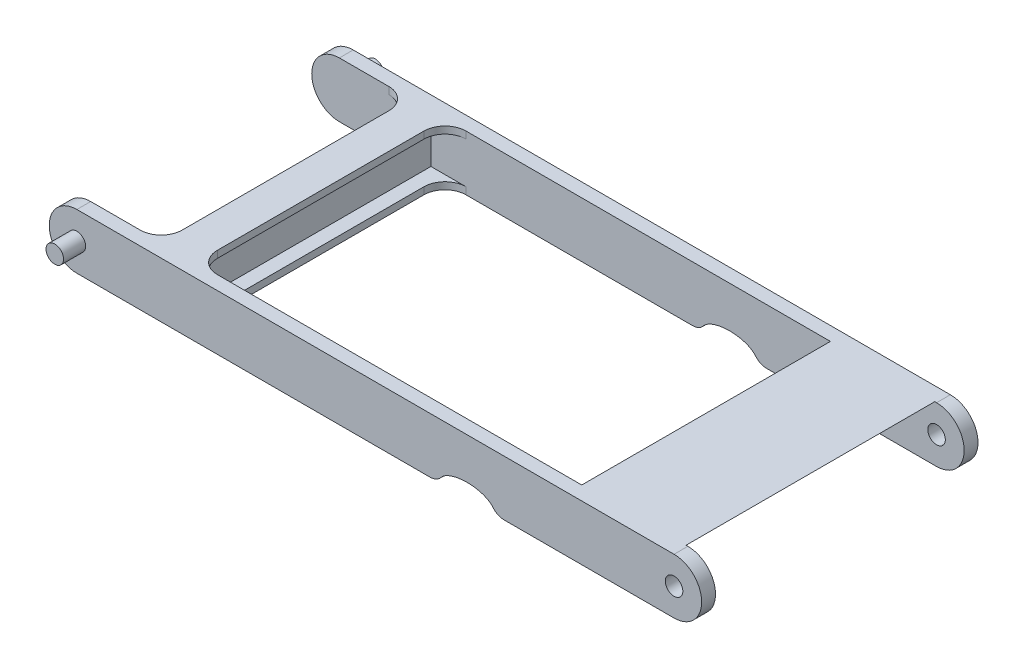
ISO-10303-21;
HEADER;
FILE_DESCRIPTION(('STEP AP214'),'2;1');
FILE_NAME('part.step','',(''),(''),'','','');
FILE_SCHEMA(('AUTOMOTIVE_DESIGN { 1 0 10303 214 1 1 1 1 }'));
ENDSEC;
DATA;
#1=APPLICATION_CONTEXT('core data for automotive mechanical design processes');
#2=APPLICATION_PROTOCOL_DEFINITION('international standard','automotive_design',2000,#1);
#3=PRODUCT_CONTEXT('',#1,'mechanical');
#4=PRODUCT('Part','Part','',(#3));
#5=PRODUCT_RELATED_PRODUCT_CATEGORY('part','',(#4));
#6=PRODUCT_DEFINITION_FORMATION('','',#4);
#7=PRODUCT_DEFINITION_CONTEXT('part definition',#1,'design');
#8=PRODUCT_DEFINITION('design','',#6,#7);
#9=PRODUCT_DEFINITION_SHAPE('','',#8);
#10=(LENGTH_UNIT() NAMED_UNIT(*) SI_UNIT(.MILLI.,.METRE.));
#11=(NAMED_UNIT(*) PLANE_ANGLE_UNIT() SI_UNIT($,.RADIAN.));
#12=(NAMED_UNIT(*) SI_UNIT($,.STERADIAN.) SOLID_ANGLE_UNIT());
#13=UNCERTAINTY_MEASURE_WITH_UNIT(LENGTH_MEASURE(1.E-05),#10,'distance_accuracy_value','');
#14=(GEOMETRIC_REPRESENTATION_CONTEXT(3) GLOBAL_UNCERTAINTY_ASSIGNED_CONTEXT((#13)) GLOBAL_UNIT_ASSIGNED_CONTEXT((#10,
#11,#12)) REPRESENTATION_CONTEXT('',''));
#15=CARTESIAN_POINT('',(0.,0.,0.));
#16=DIRECTION('',(0.,0.,1.));
#17=DIRECTION('',(1.,0.,0.));
#18=AXIS2_PLACEMENT_3D('',#15,#16,#17);
#19=CARTESIAN_POINT('',(-216.1286,0.,0.));
#20=DIRECTION('',(0.,0.,0.999999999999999));
#21=DIRECTION('',(0.999999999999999,0.,0.));
#22=AXIS2_PLACEMENT_3D('',#19,#20,#21);
#23=PLANE('',#22);
#24=CARTESIAN_POINT('',(0.,0.,0.));
#25=DIRECTION('',(0.,0.,0.999999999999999));
#26=DIRECTION('',(0.999999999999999,0.,0.));
#27=AXIS2_PLACEMENT_3D('',#24,#25,#26);
#28=CIRCLE('',#27,3.17499999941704);
#29=CARTESIAN_POINT('',(-3.17499999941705,0.,0.));
#30=VERTEX_POINT('',#29);
#31=EDGE_CURVE('E655',#30,#30,#28,.T.);
#32=ORIENTED_EDGE('',*,*,#31,.T.);
#33=EDGE_LOOP('',(#32));
#34=FACE_BOUND('',#33,.T.);
#35=DIRECTION('',(0.776120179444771,-0.630585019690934,0.));
#36=VECTOR('',#35,1.);
#37=CARTESIAN_POINT('',(-38.4142479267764,10.0000000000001,0.));
#38=LINE('',#37,#36);
#39=CARTESIAN_POINT('',(-38.4142479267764,10.,0.));
#40=VERTEX_POINT('',#39);
#41=CARTESIAN_POINT('',(-30.3474955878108,3.44589495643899,0.));
#42=VERTEX_POINT('',#41);
#43=EDGE_CURVE('E303',#40,#42,#38,.T.);
#44=ORIENTED_EDGE('',*,*,#43,.T.);
#45=DIRECTION('',(0.976495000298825,0.215540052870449,0.));
#46=VECTOR('',#45,1.);
#47=CARTESIAN_POINT('',(-30.3474955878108,3.44589495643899,0.));
#48=LINE('',#47,#46);
#49=CARTESIAN_POINT('',(-0.654402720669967,10.0000000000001,0.));
#50=VERTEX_POINT('',#49);
#51=EDGE_CURVE('E311',#42,#50,#48,.T.);
#52=ORIENTED_EDGE('',*,*,#51,.T.);
#53=DIRECTION('',(-0.999999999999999,0.,0.));
#54=VECTOR('',#53,1.);
#55=CARTESIAN_POINT('',(-216.1286,10.0000000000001,0.));
#56=LINE('',#55,#54);
#57=CARTESIAN_POINT('',(0.,10.0000000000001,0.));
#58=VERTEX_POINT('',#57);
#59=EDGE_CURVE('E631',#58,#50,#56,.T.);
#60=ORIENTED_EDGE('',*,*,#59,.F.);
#61=CARTESIAN_POINT('',(0.,0.,0.));
#62=DIRECTION('',(0.,0.,0.999999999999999));
#63=DIRECTION('',(0.999999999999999,0.,0.));
#64=AXIS2_PLACEMENT_3D('',#61,#62,#63);
#65=CIRCLE('',#64,10.0000000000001);
#66=CARTESIAN_POINT('',(0.,-10.0000000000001,0.));
#67=VERTEX_POINT('',#66);
#68=EDGE_CURVE('E635',#67,#58,#65,.T.);
#69=ORIENTED_EDGE('',*,*,#68,.F.);
#70=DIRECTION('',(1.,0.,0.));
#71=VECTOR('',#70,1.);
#72=CARTESIAN_POINT('',(0.,-10.0000000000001,0.));
#73=LINE('',#72,#71);
#74=CARTESIAN_POINT('',(-61.5458153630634,-10.0000000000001,0.));
#75=VERTEX_POINT('',#74);
#76=EDGE_CURVE('E641',#75,#67,#73,.T.);
#77=ORIENTED_EDGE('',*,*,#76,.F.);
#78=CARTESIAN_POINT('',(-61.5458153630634,-4.92000000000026,0.));
#79=DIRECTION('',(0.,0.,0.999999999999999));
#80=DIRECTION('',(0.999999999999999,0.,0.));
#81=AXIS2_PLACEMENT_3D('',#78,#79,#80);
#82=CIRCLE('',#81,5.08);
#83=CARTESIAN_POINT('',(-65.5039701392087,-8.1042441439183,0.));
#84=VERTEX_POINT('',#83);
#85=EDGE_CURVE('E584',#75,#84,#82,.F.);
#86=ORIENTED_EDGE('',*,*,#85,.T.);
#87=CARTESIAN_POINT('',(-74.9299999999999,-10.,0.));
#88=DIRECTION('',(0.,0.,0.999999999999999));
#89=DIRECTION('',(0.999999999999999,0.,0.));
#90=AXIS2_PLACEMENT_3D('',#87,#88,#89);
#91=ELLIPSE('',#90,10.16,5.08);
#92=CARTESIAN_POINT('',(-84.3560298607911,-8.1042441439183,0.));
#93=VERTEX_POINT('',#92);
#94=EDGE_CURVE('E776',#84,#93,#91,.T.);
#95=ORIENTED_EDGE('',*,*,#94,.T.);
#96=CARTESIAN_POINT('',(-88.3141846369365,-4.92000000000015,0.));
#97=DIRECTION('',(0.,0.,0.999999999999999));
#98=DIRECTION('',(0.999999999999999,0.,0.));
#99=AXIS2_PLACEMENT_3D('',#96,#97,#98);
#100=CIRCLE('',#99,5.08);
#101=CARTESIAN_POINT('',(-88.3141846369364,-10.0000000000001,0.));
#102=VERTEX_POINT('',#101);
#103=EDGE_CURVE('E581',#93,#102,#100,.F.);
#104=ORIENTED_EDGE('',*,*,#103,.T.);
#105=CARTESIAN_POINT('',(-170.2943,-10.,0.));
#106=VERTEX_POINT('',#105);
#107=EDGE_CURVE('E640',#106,#102,#73,.T.);
#108=ORIENTED_EDGE('',*,*,#107,.F.);
#109=DIRECTION('',(0.,-0.999999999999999,0.));
#110=VECTOR('',#109,1.);
#111=CARTESIAN_POINT('',(-170.2943,-7.46000000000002,0.));
#112=LINE('',#111,#110);
#113=CARTESIAN_POINT('',(-170.2943,-7.46000000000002,0.));
#114=VERTEX_POINT('',#113);
#115=EDGE_CURVE('E540',#106,#114,#112,.F.);
#116=ORIENTED_EDGE('',*,*,#115,.T.);
#117=DIRECTION('',(0.999999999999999,0.,0.));
#118=VECTOR('',#117,1.);
#119=CARTESIAN_POINT('',(-182.9943,-7.45999999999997,0.));
#120=LINE('',#119,#118);
#121=CARTESIAN_POINT('',(-182.9943,-7.45999999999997,0.));
#122=VERTEX_POINT('',#121);
#123=EDGE_CURVE('E737',#122,#114,#120,.T.);
#124=ORIENTED_EDGE('',*,*,#123,.F.);
#125=DIRECTION('',(0.,-0.999999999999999,0.));
#126=VECTOR('',#125,1.);
#127=CARTESIAN_POINT('',(-182.9943,7.45999999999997,0.));
#128=LINE('',#127,#126);
#129=CARTESIAN_POINT('',(-182.9943,7.45999999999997,0.));
#130=VERTEX_POINT('',#129);
#131=EDGE_CURVE('E739',#130,#122,#128,.T.);
#132=ORIENTED_EDGE('',*,*,#131,.F.);
#133=DIRECTION('',(-0.999999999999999,0.,0.));
#134=VECTOR('',#133,1.);
#135=CARTESIAN_POINT('',(-177.9143,7.46000000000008,0.));
#136=LINE('',#135,#134);
#137=CARTESIAN_POINT('',(-170.2943,7.46000000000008,0.));
#138=VERTEX_POINT('',#137);
#139=EDGE_CURVE('E742',#138,#130,#136,.T.);
#140=ORIENTED_EDGE('',*,*,#139,.F.);
#141=DIRECTION('',(0.,-0.999999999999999,0.));
#142=VECTOR('',#141,1.);
#143=CARTESIAN_POINT('',(-170.2943,10.0000000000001,0.));
#144=LINE('',#143,#142);
#145=CARTESIAN_POINT('',(-170.2943,10.,0.));
#146=VERTEX_POINT('',#145);
#147=EDGE_CURVE('E538',#138,#146,#144,.F.);
#148=ORIENTED_EDGE('',*,*,#147,.T.);
#149=EDGE_CURVE('E319',#40,#146,#56,.T.);
#150=ORIENTED_EDGE('',*,*,#149,.F.);
#151=EDGE_LOOP('',(#44,#52,#60,#69,#77,#86,#95,#104,#108,#116,#124,#132,#140,#148,#150));
#152=FACE_BOUND('',#151,.T.);
#153=ADVANCED_FACE('F52',(#34,#152),#23,.F.);
#154=CARTESIAN_POINT('',(-216.1286,0.,-89.999800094));
#155=DIRECTION('',(0.,0.,0.999999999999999));
#156=DIRECTION('',(0.999999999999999,0.,0.));
#157=AXIS2_PLACEMENT_3D('',#154,#155,#156);
#158=PLANE('',#157);
#159=CARTESIAN_POINT('',(0.,0.,-89.999800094));
#160=DIRECTION('',(0.,0.,0.999999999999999));
#161=DIRECTION('',(0.999999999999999,0.,0.));
#162=AXIS2_PLACEMENT_3D('',#159,#160,#161);
#163=CIRCLE('',#162,3.17499999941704);
#164=CARTESIAN_POINT('',(-3.17499999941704,0.,-89.999800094));
#165=VERTEX_POINT('',#164);
#166=EDGE_CURVE('E685',#165,#165,#163,.T.);
#167=ORIENTED_EDGE('',*,*,#166,.F.);
#168=EDGE_LOOP('',(#167));
#169=FACE_BOUND('',#168,.T.);
#170=DIRECTION('',(0.976495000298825,0.215540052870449,0.));
#171=VECTOR('',#170,1.);
#172=CARTESIAN_POINT('',(-30.3474955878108,3.44589495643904,-89.999800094));
#173=LINE('',#172,#171);
#174=CARTESIAN_POINT('',(-30.3474955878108,3.44589495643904,-89.999800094));
#175=VERTEX_POINT('',#174);
#176=CARTESIAN_POINT('',(-0.654402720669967,10.0000000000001,-89.999800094));
#177=VERTEX_POINT('',#176);
#178=EDGE_CURVE('E308',#175,#177,#173,.T.);
#179=ORIENTED_EDGE('',*,*,#178,.F.);
#180=DIRECTION('',(0.776120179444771,-0.630585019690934,0.));
#181=VECTOR('',#180,1.);
#182=CARTESIAN_POINT('',(-38.4142479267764,10.0000000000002,-89.999800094));
#183=LINE('',#182,#181);
#184=CARTESIAN_POINT('',(-38.4142479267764,10.0000000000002,-89.999800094));
#185=VERTEX_POINT('',#184);
#186=EDGE_CURVE('E74',#185,#175,#183,.T.);
#187=ORIENTED_EDGE('',*,*,#186,.F.);
#188=DIRECTION('',(-0.999999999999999,0.,0.));
#189=VECTOR('',#188,1.);
#190=CARTESIAN_POINT('',(-216.1286,10.0000000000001,-89.999800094));
#191=LINE('',#190,#189);
#192=CARTESIAN_POINT('',(-170.2943,10.0000000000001,-89.999800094));
#193=VERTEX_POINT('',#192);
#194=EDGE_CURVE('E688',#185,#193,#191,.T.);
#195=ORIENTED_EDGE('',*,*,#194,.T.);
#196=DIRECTION('',(0.,0.999999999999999,0.));
#197=VECTOR('',#196,1.);
#198=CARTESIAN_POINT('',(-170.2943,0.,-89.999800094));
#199=LINE('',#198,#197);
#200=CARTESIAN_POINT('',(-170.2943,7.46000000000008,-89.999800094));
#201=VERTEX_POINT('',#200);
#202=EDGE_CURVE('E549',#193,#201,#199,.F.);
#203=ORIENTED_EDGE('',*,*,#202,.T.);
#204=DIRECTION('',(0.999999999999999,0.,0.));
#205=VECTOR('',#204,1.);
#206=CARTESIAN_POINT('',(-177.9143,7.46000000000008,-89.999800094));
#207=LINE('',#206,#205);
#208=CARTESIAN_POINT('',(-182.9943,7.45999999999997,-89.999800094));
#209=VERTEX_POINT('',#208);
#210=EDGE_CURVE('E761',#209,#201,#207,.T.);
#211=ORIENTED_EDGE('',*,*,#210,.F.);
#212=DIRECTION('',(0.,0.999999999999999,0.));
#213=VECTOR('',#212,1.);
#214=CARTESIAN_POINT('',(-182.9943,7.45999999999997,-89.999800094));
#215=LINE('',#214,#213);
#216=CARTESIAN_POINT('',(-182.9943,-7.46000000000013,-89.999800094));
#217=VERTEX_POINT('',#216);
#218=EDGE_CURVE('E763',#217,#209,#215,.T.);
#219=ORIENTED_EDGE('',*,*,#218,.F.);
#220=DIRECTION('',(-0.999999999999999,0.,0.));
#221=VECTOR('',#220,1.);
#222=CARTESIAN_POINT('',(-182.9943,-7.46000000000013,-89.999800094));
#223=LINE('',#222,#221);
#224=CARTESIAN_POINT('',(-170.2943,-7.45999999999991,-89.999800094));
#225=VERTEX_POINT('',#224);
#226=EDGE_CURVE('E708',#225,#217,#223,.T.);
#227=ORIENTED_EDGE('',*,*,#226,.F.);
#228=DIRECTION('',(0.,0.999999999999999,0.));
#229=VECTOR('',#228,1.);
#230=CARTESIAN_POINT('',(-170.2943,0.,-89.999800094));
#231=LINE('',#230,#229);
#232=CARTESIAN_POINT('',(-170.2943,-10.,-89.999800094));
#233=VERTEX_POINT('',#232);
#234=EDGE_CURVE('E552',#225,#233,#231,.F.);
#235=ORIENTED_EDGE('',*,*,#234,.T.);
#236=DIRECTION('',(1.,0.,0.));
#237=VECTOR('',#236,1.);
#238=CARTESIAN_POINT('',(0.,-10.0000000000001,-89.999800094));
#239=LINE('',#238,#237);
#240=CARTESIAN_POINT('',(-88.3141846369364,-10.0000000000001,-89.999800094));
#241=VERTEX_POINT('',#240);
#242=EDGE_CURVE('E695',#233,#241,#239,.T.);
#243=ORIENTED_EDGE('',*,*,#242,.T.);
#244=CARTESIAN_POINT('',(-88.3141846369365,-4.92000000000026,-89.999800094));
#245=DIRECTION('',(0.,0.,0.999999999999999));
#246=DIRECTION('',(0.999999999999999,0.,0.));
#247=AXIS2_PLACEMENT_3D('',#244,#245,#246);
#248=CIRCLE('',#247,5.08);
#249=CARTESIAN_POINT('',(-84.3560298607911,-8.1042441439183,-89.999800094));
#250=VERTEX_POINT('',#249);
#251=EDGE_CURVE('E602',#241,#250,#248,.T.);
#252=ORIENTED_EDGE('',*,*,#251,.T.);
#253=CARTESIAN_POINT('',(-74.9299999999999,-10.,-89.999800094));
#254=DIRECTION('',(0.,0.,0.999999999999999));
#255=DIRECTION('',(0.999999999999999,0.,0.));
#256=AXIS2_PLACEMENT_3D('',#253,#254,#255);
#257=ELLIPSE('',#256,10.16,5.08);
#258=CARTESIAN_POINT('',(-65.5039701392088,-8.1042441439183,-89.999800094));
#259=VERTEX_POINT('',#258);
#260=EDGE_CURVE('E323',#259,#250,#257,.T.);
#261=ORIENTED_EDGE('',*,*,#260,.F.);
#262=CARTESIAN_POINT('',(-61.5458153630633,-4.92000000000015,-89.999800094));
#263=DIRECTION('',(0.,0.,0.999999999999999));
#264=DIRECTION('',(0.999999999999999,0.,0.));
#265=AXIS2_PLACEMENT_3D('',#262,#263,#264);
#266=CIRCLE('',#265,5.08);
#267=CARTESIAN_POINT('',(-61.5458153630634,-10.0000000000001,-89.999800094));
#268=VERTEX_POINT('',#267);
#269=EDGE_CURVE('E604',#259,#268,#266,.T.);
#270=ORIENTED_EDGE('',*,*,#269,.T.);
#271=CARTESIAN_POINT('',(0.,-10.0000000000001,-89.999800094));
#272=VERTEX_POINT('',#271);
#273=EDGE_CURVE('E696',#268,#272,#239,.T.);
#274=ORIENTED_EDGE('',*,*,#273,.T.);
#275=CARTESIAN_POINT('',(0.,0.,-89.999800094));
#276=DIRECTION('',(0.,0.,0.999999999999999));
#277=DIRECTION('',(0.999999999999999,0.,0.));
#278=AXIS2_PLACEMENT_3D('',#275,#276,#277);
#279=CIRCLE('',#278,10.0000000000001);
#280=CARTESIAN_POINT('',(0.,10.0000000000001,-89.999800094));
#281=VERTEX_POINT('',#280);
#282=EDGE_CURVE('E689',#272,#281,#279,.T.);
#283=ORIENTED_EDGE('',*,*,#282,.T.);
#284=EDGE_CURVE('E672',#281,#177,#191,.T.);
#285=ORIENTED_EDGE('',*,*,#284,.T.);
#286=EDGE_LOOP('',(#179,#187,#195,#203,#211,#219,#227,#235,#243,#252,#261,#270,#274,#283,#285));
#287=FACE_BOUND('',#286,.T.);
#288=ADVANCED_FACE('F408',(#169,#287),#158,.T.);
#289=CARTESIAN_POINT('',(0.,-10.0000000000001,5.00000000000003));
#290=DIRECTION('',(0.,1.,0.));
#291=DIRECTION('',(-1.,0.,0.));
#292=AXIS2_PLACEMENT_3D('',#289,#290,#291);
#293=PLANE('',#292);
#294=DIRECTION('',(1.,0.,0.));
#295=VECTOR('',#294,1.);
#296=CARTESIAN_POINT('',(0.,-10.0000000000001,-94.999800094));
#297=LINE('',#296,#295);
#298=CARTESIAN_POINT('',(-216.1286,-10.0000000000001,-94.999800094));
#299=VERTEX_POINT('',#298);
#300=CARTESIAN_POINT('',(-88.3141846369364,-10.0000000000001,-94.999800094));
#301=VERTEX_POINT('',#300);
#302=EDGE_CURVE('E678',#299,#301,#297,.T.);
#303=ORIENTED_EDGE('',*,*,#302,.T.);
#304=DIRECTION('',(0.,0.,0.999999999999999));
#305=VECTOR('',#304,1.);
#306=CARTESIAN_POINT('',(-88.3141846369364,-10.0000000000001,5.));
#307=LINE('',#306,#305);
#308=EDGE_CURVE('E606',#301,#241,#307,.T.);
#309=ORIENTED_EDGE('',*,*,#308,.T.);
#310=ORIENTED_EDGE('',*,*,#242,.F.);
#311=CARTESIAN_POINT('',(-170.2943,-10.,-82.379800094));
#312=DIRECTION('',(0.,1.,0.));
#313=DIRECTION('',(-1.,0.,0.));
#314=AXIS2_PLACEMENT_3D('',#311,#312,#313);
#315=CIRCLE('',#314,7.62);
#316=CARTESIAN_POINT('',(-177.9143,-10.0000000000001,-82.3798000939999));
#317=VERTEX_POINT('',#316);
#318=EDGE_CURVE('E516',#233,#317,#315,.T.);
#319=ORIENTED_EDGE('',*,*,#318,.T.);
#320=DIRECTION('',(0.,0.,0.999999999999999));
#321=VECTOR('',#320,1.);
#322=CARTESIAN_POINT('',(-177.9143,-10.,-113.691359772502));
#323=LINE('',#322,#321);
#324=CARTESIAN_POINT('',(-177.9143,-10.0000000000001,-7.61999999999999));
#325=VERTEX_POINT('',#324);
#326=EDGE_CURVE('E734',#317,#325,#323,.T.);
#327=ORIENTED_EDGE('',*,*,#326,.T.);
#328=CARTESIAN_POINT('',(-170.2943,-10.,-7.61999999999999));
#329=DIRECTION('',(0.,1.,0.));
#330=DIRECTION('',(-1.,0.,0.));
#331=AXIS2_PLACEMENT_3D('',#328,#329,#330);
#332=CIRCLE('',#331,7.62);
#333=EDGE_CURVE('E509',#325,#106,#332,.T.);
#334=ORIENTED_EDGE('',*,*,#333,.T.);
#335=ORIENTED_EDGE('',*,*,#107,.T.);
#336=DIRECTION('',(0.,0.,0.999999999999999));
#337=VECTOR('',#336,1.);
#338=CARTESIAN_POINT('',(-88.3141846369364,-10.0000000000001,5.));
#339=LINE('',#338,#337);
#340=CARTESIAN_POINT('',(-88.3141846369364,-10.0000000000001,5.));
#341=VERTEX_POINT('',#340);
#342=EDGE_CURVE('E609',#102,#341,#339,.T.);
#343=ORIENTED_EDGE('',*,*,#342,.T.);
#344=DIRECTION('',(1.,0.,0.));
#345=VECTOR('',#344,1.);
#346=CARTESIAN_POINT('',(0.,-10.0000000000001,5.00000000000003));
#347=LINE('',#346,#345);
#348=CARTESIAN_POINT('',(-216.1286,-10.0000000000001,5.));
#349=VERTEX_POINT('',#348);
#350=EDGE_CURVE('E649',#349,#341,#347,.T.);
#351=ORIENTED_EDGE('',*,*,#350,.F.);
#352=DIRECTION('',(0.,0.,-0.999999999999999));
#353=VECTOR('',#352,1.);
#354=CARTESIAN_POINT('',(-216.1286,-10.0000000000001,5.));
#355=LINE('',#354,#353);
#356=CARTESIAN_POINT('',(-216.1286,-10.0000000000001,0.));
#357=VERTEX_POINT('',#356);
#358=EDGE_CURVE('E618',#349,#357,#355,.T.);
#359=ORIENTED_EDGE('',*,*,#358,.T.);
#360=CARTESIAN_POINT('',(-198.2343,-10.0000000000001,0.));
#361=VERTEX_POINT('',#360);
#362=EDGE_CURVE('E637',#357,#361,#73,.T.);
#363=ORIENTED_EDGE('',*,*,#362,.T.);
#364=CARTESIAN_POINT('',(-198.2343,-10.0000000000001,-7.62000000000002));
#365=DIRECTION('',(0.,1.,0.));
#366=DIRECTION('',(-1.,0.,0.));
#367=AXIS2_PLACEMENT_3D('',#364,#365,#366);
#368=CIRCLE('',#367,7.62);
#369=CARTESIAN_POINT('',(-190.6143,-10.0000000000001,-7.61999999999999));
#370=VERTEX_POINT('',#369);
#371=EDGE_CURVE('E14',#361,#370,#368,.T.);
#372=ORIENTED_EDGE('',*,*,#371,.T.);
#373=DIRECTION('',(0.,0.,0.999999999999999));
#374=VECTOR('',#373,1.);
#375=CARTESIAN_POINT('',(-190.6143,-10.0000000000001,-113.691359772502));
#376=LINE('',#375,#374);
#377=CARTESIAN_POINT('',(-190.6143,-10.0000000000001,-82.3798000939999));
#378=VERTEX_POINT('',#377);
#379=EDGE_CURVE('E705',#378,#370,#376,.T.);
#380=ORIENTED_EDGE('',*,*,#379,.F.);
#381=CARTESIAN_POINT('',(-198.2343,-10.0000000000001,-82.3798000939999));
#382=DIRECTION('',(0.,1.,0.));
#383=DIRECTION('',(-1.,0.,0.));
#384=AXIS2_PLACEMENT_3D('',#381,#382,#383);
#385=CIRCLE('',#384,7.62);
#386=CARTESIAN_POINT('',(-198.2343,-10.0000000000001,-89.999800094));
#387=VERTEX_POINT('',#386);
#388=EDGE_CURVE('E528',#378,#387,#385,.T.);
#389=ORIENTED_EDGE('',*,*,#388,.T.);
#390=CARTESIAN_POINT('',(-216.1286,-10.0000000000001,-89.999800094));
#391=VERTEX_POINT('',#390);
#392=EDGE_CURVE('E692',#391,#387,#239,.T.);
#393=ORIENTED_EDGE('',*,*,#392,.F.);
#394=DIRECTION('',(0.,0.,-0.999999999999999));
#395=VECTOR('',#394,1.);
#396=CARTESIAN_POINT('',(-216.1286,-10.0000000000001,-89.999800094));
#397=LINE('',#396,#395);
#398=EDGE_CURVE('E658',#391,#299,#397,.T.);
#399=ORIENTED_EDGE('',*,*,#398,.T.);
#400=EDGE_LOOP('',(#303,#309,#310,#319,#327,#334,#335,#343,#351,#359,#363,#372,#380,#389,#393,#399));
#401=FACE_BOUND('',#400,.T.);
#402=ADVANCED_FACE('F442',(#401),#293,.F.);
#403=CARTESIAN_POINT('',(-61.5458153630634,-10.0000000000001,5.));
#404=VERTEX_POINT('',#403);
#405=CARTESIAN_POINT('',(0.,-10.0000000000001,5.00000000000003));
#406=VERTEX_POINT('',#405);
#407=EDGE_CURVE('E652',#404,#406,#347,.T.);
#408=ORIENTED_EDGE('',*,*,#407,.F.);
#409=DIRECTION('',(0.,0.,0.999999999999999));
#410=VECTOR('',#409,1.);
#411=CARTESIAN_POINT('',(-61.5458153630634,-10.0000000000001,5.));
#412=LINE('',#411,#410);
#413=EDGE_CURVE('E578',#404,#75,#412,.F.);
#414=ORIENTED_EDGE('',*,*,#413,.T.);
#415=ORIENTED_EDGE('',*,*,#76,.T.);
#416=DIRECTION('',(0.,0.,-0.999999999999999));
#417=VECTOR('',#416,1.);
#418=CARTESIAN_POINT('',(0.,-10.0000000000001,5.00000000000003));
#419=LINE('',#418,#417);
#420=EDGE_CURVE('E621',#406,#67,#419,.T.);
#421=ORIENTED_EDGE('',*,*,#420,.F.);
#422=EDGE_LOOP('',(#408,#414,#415,#421));
#423=FACE_BOUND('',#422,.T.);
#424=ADVANCED_FACE('F443',(#423),#293,.F.);
#425=CARTESIAN_POINT('',(-198.2343,10.0000000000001,0.));
#426=VERTEX_POINT('',#425);
#427=CARTESIAN_POINT('',(-216.1286,10.0000000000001,0.));
#428=VERTEX_POINT('',#427);
#429=EDGE_CURVE('E634',#426,#428,#56,.T.);
#430=ORIENTED_EDGE('',*,*,#429,.F.);
#431=DIRECTION('',(0.,0.999999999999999,0.));
#432=VECTOR('',#431,1.);
#433=CARTESIAN_POINT('',(-198.2343,7.46000000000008,0.));
#434=LINE('',#433,#432);
#435=CARTESIAN_POINT('',(-198.2343,7.46000000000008,0.));
#436=VERTEX_POINT('',#435);
#437=EDGE_CURVE('E497',#426,#436,#434,.F.);
#438=ORIENTED_EDGE('',*,*,#437,.T.);
#439=DIRECTION('',(-0.999999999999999,0.,0.));
#440=VECTOR('',#439,1.);
#441=CARTESIAN_POINT('',(-185.5343,7.46000000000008,0.));
#442=LINE('',#441,#440);
#443=CARTESIAN_POINT('',(-185.5343,7.46000000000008,0.));
#444=VERTEX_POINT('',#443);
#445=EDGE_CURVE('E745',#444,#436,#442,.T.);
#446=ORIENTED_EDGE('',*,*,#445,.F.);
#447=DIRECTION('',(0.,0.999999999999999,0.));
#448=VECTOR('',#447,1.);
#449=CARTESIAN_POINT('',(-185.5343,-7.46000000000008,0.));
#450=LINE('',#449,#448);
#451=CARTESIAN_POINT('',(-185.5343,-7.46000000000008,0.));
#452=VERTEX_POINT('',#451);
#453=EDGE_CURVE('E747',#452,#444,#450,.T.);
#454=ORIENTED_EDGE('',*,*,#453,.F.);
#455=DIRECTION('',(0.999999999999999,0.,0.));
#456=VECTOR('',#455,1.);
#457=CARTESIAN_POINT('',(-190.6143,-7.46000000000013,0.));
#458=LINE('',#457,#456);
#459=CARTESIAN_POINT('',(-198.2343,-7.46000000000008,0.));
#460=VERTEX_POINT('',#459);
#461=EDGE_CURVE('E750',#460,#452,#458,.T.);
#462=ORIENTED_EDGE('',*,*,#461,.F.);
#463=DIRECTION('',(0.,0.999999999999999,0.));
#464=VECTOR('',#463,1.);
#465=CARTESIAN_POINT('',(-198.2343,-10.0000000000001,0.));
#466=LINE('',#465,#464);
#467=EDGE_CURVE('E536',#460,#361,#466,.F.);
#468=ORIENTED_EDGE('',*,*,#467,.T.);
#469=ORIENTED_EDGE('',*,*,#362,.F.);
#470=CARTESIAN_POINT('',(-216.1286,0.,0.));
#471=DIRECTION('',(0.,0.,0.999999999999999));
#472=DIRECTION('',(0.999999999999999,0.,0.));
#473=AXIS2_PLACEMENT_3D('',#470,#471,#472);
#474=CIRCLE('',#473,10.0000000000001);
#475=EDGE_CURVE('E642',#428,#357,#474,.T.);
#476=ORIENTED_EDGE('',*,*,#475,.F.);
#477=EDGE_LOOP('',(#430,#438,#446,#454,#462,#468,#469,#476));
#478=FACE_BOUND('',#477,.T.);
#479=ADVANCED_FACE('F406',(#478),#23,.F.);
#480=DIRECTION('',(0.999999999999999,0.,0.));
#481=VECTOR('',#480,1.);
#482=CARTESIAN_POINT('',(-185.5343,7.46000000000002,-89.999800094));
#483=LINE('',#482,#481);
#484=CARTESIAN_POINT('',(-198.2343,7.46000000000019,-89.999800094));
#485=VERTEX_POINT('',#484);
#486=CARTESIAN_POINT('',(-185.5343,7.46000000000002,-89.999800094));
#487=VERTEX_POINT('',#486);
#488=EDGE_CURVE('E758',#485,#487,#483,.T.);
#489=ORIENTED_EDGE('',*,*,#488,.F.);
#490=DIRECTION('',(0.,-0.999999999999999,0.));
#491=VECTOR('',#490,1.);
#492=CARTESIAN_POINT('',(-198.2343,0.,-89.999800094));
#493=LINE('',#492,#491);
#494=CARTESIAN_POINT('',(-198.2343,10.0000000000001,-89.999800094));
#495=VERTEX_POINT('',#494);
#496=EDGE_CURVE('E566',#485,#495,#493,.F.);
#497=ORIENTED_EDGE('',*,*,#496,.T.);
#498=CARTESIAN_POINT('',(-216.1286,10.0000000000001,-89.999800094));
#499=VERTEX_POINT('',#498);
#500=EDGE_CURVE('E686',#495,#499,#191,.T.);
#501=ORIENTED_EDGE('',*,*,#500,.T.);
#502=CARTESIAN_POINT('',(-216.1286,0.,-89.999800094));
#503=DIRECTION('',(0.,0.,0.999999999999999));
#504=DIRECTION('',(0.999999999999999,0.,0.));
#505=AXIS2_PLACEMENT_3D('',#502,#503,#504);
#506=CIRCLE('',#505,10.0000000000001);
#507=EDGE_CURVE('E675',#499,#391,#506,.T.);
#508=ORIENTED_EDGE('',*,*,#507,.T.);
#509=ORIENTED_EDGE('',*,*,#392,.T.);
#510=DIRECTION('',(0.,-0.999999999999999,0.));
#511=VECTOR('',#510,1.);
#512=CARTESIAN_POINT('',(-198.2343,0.,-89.999800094));
#513=LINE('',#512,#511);
#514=CARTESIAN_POINT('',(-198.2343,-7.46000000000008,-89.999800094));
#515=VERTEX_POINT('',#514);
#516=EDGE_CURVE('E568',#387,#515,#513,.F.);
#517=ORIENTED_EDGE('',*,*,#516,.T.);
#518=DIRECTION('',(-0.999999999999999,0.,0.));
#519=VECTOR('',#518,1.);
#520=CARTESIAN_POINT('',(-190.6143,-7.46000000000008,-89.999800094));
#521=LINE('',#520,#519);
#522=CARTESIAN_POINT('',(-185.5343,-7.46000000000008,-89.999800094));
#523=VERTEX_POINT('',#522);
#524=EDGE_CURVE('E702',#523,#515,#521,.T.);
#525=ORIENTED_EDGE('',*,*,#524,.F.);
#526=DIRECTION('',(0.,-0.999999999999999,0.));
#527=VECTOR('',#526,1.);
#528=CARTESIAN_POINT('',(-185.5343,-7.46000000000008,-89.999800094));
#529=LINE('',#528,#527);
#530=EDGE_CURVE('E755',#487,#523,#529,.T.);
#531=ORIENTED_EDGE('',*,*,#530,.F.);
#532=EDGE_LOOP('',(#489,#497,#501,#508,#509,#517,#525,#531));
#533=FACE_BOUND('',#532,.T.);
#534=ADVANCED_FACE('F402',(#533),#158,.T.);
#535=CARTESIAN_POINT('',(-216.1286,0.,5.));
#536=DIRECTION('',(0.,0.,0.999999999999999));
#537=DIRECTION('',(0.999999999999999,0.,0.));
#538=AXIS2_PLACEMENT_3D('',#535,#536,#537);
#539=PLANE('',#538);
#540=ORIENTED_EDGE('',*,*,#350,.T.);
#541=CARTESIAN_POINT('',(-88.3141846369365,-4.92000000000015,5.));
#542=DIRECTION('',(0.,0.,0.999999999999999));
#543=DIRECTION('',(0.999999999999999,0.,0.));
#544=AXIS2_PLACEMENT_3D('',#541,#542,#543);
#545=CIRCLE('',#544,5.08);
#546=CARTESIAN_POINT('',(-84.3560298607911,-8.1042441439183,5.));
#547=VERTEX_POINT('',#546);
#548=EDGE_CURVE('E590',#341,#547,#545,.T.);
#549=ORIENTED_EDGE('',*,*,#548,.T.);
#550=CARTESIAN_POINT('',(-74.9299999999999,-10.,5.));
#551=DIRECTION('',(0.,0.,0.999999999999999));
#552=DIRECTION('',(0.999999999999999,0.,0.));
#553=AXIS2_PLACEMENT_3D('',#550,#551,#552);
#554=ELLIPSE('',#553,10.16,5.08);
#555=CARTESIAN_POINT('',(-65.5039701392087,-8.1042441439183,5.));
#556=VERTEX_POINT('',#555);
#557=EDGE_CURVE('E320',#556,#547,#554,.T.);
#558=ORIENTED_EDGE('',*,*,#557,.F.);
#559=CARTESIAN_POINT('',(-61.5458153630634,-4.92000000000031,5.));
#560=DIRECTION('',(0.,0.,0.999999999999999));
#561=DIRECTION('',(0.999999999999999,0.,0.));
#562=AXIS2_PLACEMENT_3D('',#559,#560,#561);
#563=CIRCLE('',#562,5.08);
#564=EDGE_CURVE('E592',#556,#404,#563,.T.);
#565=ORIENTED_EDGE('',*,*,#564,.T.);
#566=ORIENTED_EDGE('',*,*,#407,.T.);
#567=CARTESIAN_POINT('',(0.,0.,5.));
#568=DIRECTION('',(0.,0.,0.999999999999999));
#569=DIRECTION('',(0.999999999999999,0.,0.));
#570=AXIS2_PLACEMENT_3D('',#567,#568,#569);
#571=CIRCLE('',#570,10.0000000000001);
#572=CARTESIAN_POINT('',(0.,10.0000000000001,5.));
#573=VERTEX_POINT('',#572);
#574=EDGE_CURVE('E647',#406,#573,#571,.T.);
#575=ORIENTED_EDGE('',*,*,#574,.T.);
#576=DIRECTION('',(-0.999999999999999,0.,0.));
#577=VECTOR('',#576,1.);
#578=CARTESIAN_POINT('',(-216.1286,10.0000000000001,5.));
#579=LINE('',#578,#577);
#580=CARTESIAN_POINT('',(-216.1286,10.0000000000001,5.));
#581=VERTEX_POINT('',#580);
#582=EDGE_CURVE('E630',#573,#581,#579,.T.);
#583=ORIENTED_EDGE('',*,*,#582,.T.);
#584=CARTESIAN_POINT('',(-216.1286,0.,5.));
#585=DIRECTION('',(0.,0.,0.999999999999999));
#586=DIRECTION('',(0.999999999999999,0.,0.));
#587=AXIS2_PLACEMENT_3D('',#584,#585,#586);
#588=CIRCLE('',#587,10.0000000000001);
#589=EDGE_CURVE('E633',#581,#349,#588,.T.);
#590=ORIENTED_EDGE('',*,*,#589,.T.);
#591=EDGE_LOOP('',(#540,#549,#558,#565,#566,#575,#583,#590));
#592=FACE_BOUND('',#591,.T.);
#593=CARTESIAN_POINT('',(-216.1286,0.,5.));
#594=DIRECTION('',(0.,0.,0.999999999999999));
#595=DIRECTION('',(0.999999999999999,0.,0.));
#596=AXIS2_PLACEMENT_3D('',#593,#594,#595);
#597=CIRCLE('',#596,3.17499999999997);
#598=CARTESIAN_POINT('',(-219.3036,0.,5.00000000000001));
#599=VERTEX_POINT('',#598);
#600=EDGE_CURVE('E773',#599,#599,#597,.T.);
#601=ORIENTED_EDGE('',*,*,#600,.F.);
#602=EDGE_LOOP('',(#601));
#603=FACE_BOUND('',#602,.T.);
#604=CARTESIAN_POINT('',(0.,0.,5.));
#605=DIRECTION('',(0.,0.,0.999999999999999));
#606=DIRECTION('',(0.999999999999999,0.,0.));
#607=AXIS2_PLACEMENT_3D('',#604,#605,#606);
#608=CIRCLE('',#607,3.17499999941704);
#609=CARTESIAN_POINT('',(-3.17499999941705,0.,5.00000000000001));
#610=VERTEX_POINT('',#609);
#611=EDGE_CURVE('E645',#610,#610,#608,.T.);
#612=ORIENTED_EDGE('',*,*,#611,.F.);
#613=EDGE_LOOP('',(#612));
#614=FACE_BOUND('',#613,.T.);
#615=ADVANCED_FACE('F405',(#592,#603,#614),#539,.T.);
#616=CARTESIAN_POINT('',(-216.1286,0.,5.));
#617=DIRECTION('',(0.,0.,-0.999999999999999));
#618=DIRECTION('',(-0.999999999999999,0.,0.));
#619=AXIS2_PLACEMENT_3D('',#616,#617,#618);
#620=CYLINDRICAL_SURFACE('',#619,10.0000000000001);
#621=ORIENTED_EDGE('',*,*,#475,.T.);
#622=ORIENTED_EDGE('',*,*,#358,.F.);
#623=ORIENTED_EDGE('',*,*,#589,.F.);
#624=DIRECTION('',(0.,0.,-0.999999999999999));
#625=VECTOR('',#624,1.);
#626=CARTESIAN_POINT('',(-216.1286,10.0000000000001,5.));
#627=LINE('',#626,#625);
#628=EDGE_CURVE('E627',#581,#428,#627,.T.);
#629=ORIENTED_EDGE('',*,*,#628,.T.);
#630=EDGE_LOOP('',(#621,#622,#623,#629));
#631=FACE_BOUND('',#630,.T.);
#632=ADVANCED_FACE('F427',(#631),#620,.T.);
#633=ORIENTED_EDGE('',*,*,#273,.F.);
#634=DIRECTION('',(0.,0.,0.999999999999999));
#635=VECTOR('',#634,1.);
#636=CARTESIAN_POINT('',(-61.5458153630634,-10.0000000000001,5.));
#637=LINE('',#636,#635);
#638=CARTESIAN_POINT('',(-61.5458153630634,-10.0000000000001,-94.999800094));
#639=VERTEX_POINT('',#638);
#640=EDGE_CURVE('E575',#268,#639,#637,.F.);
#641=ORIENTED_EDGE('',*,*,#640,.T.);
#642=CARTESIAN_POINT('',(0.,-10.0000000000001,-94.999800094));
#643=VERTEX_POINT('',#642);
#644=EDGE_CURVE('E681',#639,#643,#297,.T.);
#645=ORIENTED_EDGE('',*,*,#644,.T.);
#646=DIRECTION('',(0.,0.,-0.999999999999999));
#647=VECTOR('',#646,1.);
#648=CARTESIAN_POINT('',(0.,-10.0000000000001,-89.999800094));
#649=LINE('',#648,#647);
#650=EDGE_CURVE('E663',#272,#643,#649,.T.);
#651=ORIENTED_EDGE('',*,*,#650,.F.);
#652=EDGE_LOOP('',(#633,#641,#645,#651));
#653=FACE_BOUND('',#652,.T.);
#654=ADVANCED_FACE('F437',(#653),#293,.F.);
#655=CARTESIAN_POINT('',(0.,0.,5.));
#656=DIRECTION('',(0.,0.,-0.999999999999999));
#657=DIRECTION('',(-0.999999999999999,0.,0.));
#658=AXIS2_PLACEMENT_3D('',#655,#656,#657);
#659=CYLINDRICAL_SURFACE('',#658,10.0000000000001);
#660=ORIENTED_EDGE('',*,*,#68,.T.);
#661=DIRECTION('',(0.,0.,-0.999999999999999));
#662=VECTOR('',#661,1.);
#663=CARTESIAN_POINT('',(0.,10.0000000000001,5.));
#664=LINE('',#663,#662);
#665=EDGE_CURVE('E624',#573,#58,#664,.T.);
#666=ORIENTED_EDGE('',*,*,#665,.F.);
#667=ORIENTED_EDGE('',*,*,#574,.F.);
#668=ORIENTED_EDGE('',*,*,#420,.T.);
#669=EDGE_LOOP('',(#660,#666,#667,#668));
#670=FACE_BOUND('',#669,.T.);
#671=ADVANCED_FACE('F434',(#670),#659,.T.);
#672=CARTESIAN_POINT('',(-216.1286,10.0000000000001,5.));
#673=DIRECTION('',(0.,-0.999999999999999,0.));
#674=DIRECTION('',(0.999999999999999,0.,0.));
#675=AXIS2_PLACEMENT_3D('',#672,#673,#674);
#676=PLANE('',#675);
#677=DIRECTION('',(0.,0.,-0.999999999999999));
#678=VECTOR('',#677,1.);
#679=CARTESIAN_POINT('',(-38.4142479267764,10.0000000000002,38.3244334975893));
#680=LINE('',#679,#678);
#681=EDGE_CURVE('E67',#40,#185,#680,.T.);
#682=ORIENTED_EDGE('',*,*,#681,.F.);
#683=ORIENTED_EDGE('',*,*,#149,.T.);
#684=CARTESIAN_POINT('',(-170.2943,10.0000000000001,-7.61999999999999));
#685=DIRECTION('',(0.,-0.999999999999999,0.));
#686=DIRECTION('',(0.999999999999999,0.,0.));
#687=AXIS2_PLACEMENT_3D('',#684,#685,#686);
#688=CIRCLE('',#687,7.62);
#689=CARTESIAN_POINT('',(-177.9143,10.0000000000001,-7.61999999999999));
#690=VERTEX_POINT('',#689);
#691=EDGE_CURVE('E511',#146,#690,#688,.T.);
#692=ORIENTED_EDGE('',*,*,#691,.T.);
#693=DIRECTION('',(0.,0.,0.999999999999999));
#694=VECTOR('',#693,1.);
#695=CARTESIAN_POINT('',(-177.9143,10.0000000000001,-113.691359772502));
#696=LINE('',#695,#694);
#697=CARTESIAN_POINT('',(-177.9143,10.0000000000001,-82.3798000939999));
#698=VERTEX_POINT('',#697);
#699=EDGE_CURVE('E721',#698,#690,#696,.T.);
#700=ORIENTED_EDGE('',*,*,#699,.F.);
#701=CARTESIAN_POINT('',(-170.2943,10.0000000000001,-82.3798000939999));
#702=DIRECTION('',(0.,-0.999999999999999,0.));
#703=DIRECTION('',(0.999999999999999,0.,0.));
#704=AXIS2_PLACEMENT_3D('',#701,#702,#703);
#705=CIRCLE('',#704,7.62);
#706=EDGE_CURVE('E523',#698,#193,#705,.T.);
#707=ORIENTED_EDGE('',*,*,#706,.T.);
#708=ORIENTED_EDGE('',*,*,#194,.F.);
#709=EDGE_LOOP('',(#682,#683,#692,#700,#707,#708));
#710=FACE_BOUND('',#709,.T.);
#711=ORIENTED_EDGE('',*,*,#59,.T.);
#712=DIRECTION('',(0.,0.,-0.999999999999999));
#713=VECTOR('',#712,1.);
#714=CARTESIAN_POINT('',(-0.65440272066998,10.0000000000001,38.3244334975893));
#715=LINE('',#714,#713);
#716=EDGE_CURVE('E313',#50,#177,#715,.T.);
#717=ORIENTED_EDGE('',*,*,#716,.T.);
#718=ORIENTED_EDGE('',*,*,#284,.F.);
#719=DIRECTION('',(0.,0.,-0.999999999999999));
#720=VECTOR('',#719,1.);
#721=CARTESIAN_POINT('',(0.,10.0000000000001,-89.999800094));
#722=LINE('',#721,#720);
#723=CARTESIAN_POINT('',(0.,10.0000000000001,-94.999800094));
#724=VERTEX_POINT('',#723);
#725=EDGE_CURVE('E666',#281,#724,#722,.T.);
#726=ORIENTED_EDGE('',*,*,#725,.T.);
#727=DIRECTION('',(-0.999999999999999,0.,0.));
#728=VECTOR('',#727,1.);
#729=CARTESIAN_POINT('',(-216.1286,10.0000000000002,-94.999800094));
#730=LINE('',#729,#728);
#731=CARTESIAN_POINT('',(-216.1286,10.0000000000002,-94.999800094));
#732=VERTEX_POINT('',#731);
#733=EDGE_CURVE('E673',#724,#732,#730,.T.);
#734=ORIENTED_EDGE('',*,*,#733,.T.);
#735=DIRECTION('',(0.,0.,-0.999999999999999));
#736=VECTOR('',#735,1.);
#737=CARTESIAN_POINT('',(-216.1286,10.0000000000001,-89.999800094));
#738=LINE('',#737,#736);
#739=EDGE_CURVE('E669',#499,#732,#738,.T.);
#740=ORIENTED_EDGE('',*,*,#739,.F.);
#741=ORIENTED_EDGE('',*,*,#500,.F.);
#742=CARTESIAN_POINT('',(-198.2343,10.0000000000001,-82.3798000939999));
#743=DIRECTION('',(0.,-0.999999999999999,0.));
#744=DIRECTION('',(0.999999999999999,0.,0.));
#745=AXIS2_PLACEMENT_3D('',#742,#743,#744);
#746=CIRCLE('',#745,7.62);
#747=CARTESIAN_POINT('',(-190.6143,10.0000000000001,-82.3798000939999));
#748=VERTEX_POINT('',#747);
#749=EDGE_CURVE('E530',#495,#748,#746,.T.);
#750=ORIENTED_EDGE('',*,*,#749,.T.);
#751=DIRECTION('',(0.,0.,0.999999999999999));
#752=VECTOR('',#751,1.);
#753=CARTESIAN_POINT('',(-190.6143,10.0000000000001,-113.691359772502));
#754=LINE('',#753,#752);
#755=CARTESIAN_POINT('',(-190.6143,10.0000000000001,-7.61999999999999));
#756=VERTEX_POINT('',#755);
#757=EDGE_CURVE('E718',#748,#756,#754,.T.);
#758=ORIENTED_EDGE('',*,*,#757,.T.);
#759=CARTESIAN_POINT('',(-198.2343,10.0000000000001,-7.61999999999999));
#760=DIRECTION('',(0.,-0.999999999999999,0.));
#761=DIRECTION('',(0.999999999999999,0.,0.));
#762=AXIS2_PLACEMENT_3D('',#759,#760,#761);
#763=CIRCLE('',#762,7.62);
#764=EDGE_CURVE('E502',#756,#426,#763,.T.);
#765=ORIENTED_EDGE('',*,*,#764,.T.);
#766=ORIENTED_EDGE('',*,*,#429,.T.);
#767=ORIENTED_EDGE('',*,*,#628,.F.);
#768=ORIENTED_EDGE('',*,*,#582,.F.);
#769=ORIENTED_EDGE('',*,*,#665,.T.);
#770=EDGE_LOOP('',(#711,#717,#718,#726,#734,#740,#741,#750,#758,#765,#766,#767,#768,#769));
#771=FACE_BOUND('',#770,.T.);
#772=ADVANCED_FACE('F423',(#710,#771),#676,.F.);
#773=CARTESIAN_POINT('',(0.,0.,5.));
#774=DIRECTION('',(0.,0.,-0.999999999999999));
#775=DIRECTION('',(-0.999999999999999,0.,0.));
#776=AXIS2_PLACEMENT_3D('',#773,#774,#775);
#777=CYLINDRICAL_SURFACE('',#776,3.17499999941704);
#778=CARTESIAN_POINT('',(-3.17499999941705,0.,5.00000000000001));
#779=CARTESIAN_POINT('',(-3.17499999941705,0.,4.94791666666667));
#780=CARTESIAN_POINT('',(-3.17499999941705,0.,4.89583333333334));
#781=CARTESIAN_POINT('',(-3.17499999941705,0.,4.79166666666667));
#782=CARTESIAN_POINT('',(-3.17499999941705,0.,4.73958333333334));
#783=CARTESIAN_POINT('',(-3.17499999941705,0.,4.63541666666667));
#784=CARTESIAN_POINT('',(-3.17499999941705,0.,4.58333333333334));
#785=CARTESIAN_POINT('',(-3.17499999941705,0.,4.47916666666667));
#786=CARTESIAN_POINT('',(-3.17499999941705,0.,4.42708333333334));
#787=CARTESIAN_POINT('',(-3.17499999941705,0.,4.32291666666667));
#788=CARTESIAN_POINT('',(-3.17499999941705,0.,4.27083333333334));
#789=CARTESIAN_POINT('',(-3.17499999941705,0.,4.16666666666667));
#790=CARTESIAN_POINT('',(-3.17499999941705,0.,4.11458333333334));
#791=CARTESIAN_POINT('',(-3.17499999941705,0.,4.01041666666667));
#792=CARTESIAN_POINT('',(-3.17499999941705,0.,3.95833333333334));
#793=CARTESIAN_POINT('',(-3.17499999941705,0.,3.85416666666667));
#794=CARTESIAN_POINT('',(-3.17499999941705,0.,3.80208333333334));
#795=CARTESIAN_POINT('',(-3.17499999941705,0.,3.69791666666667));
#796=CARTESIAN_POINT('',(-3.17499999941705,0.,3.64583333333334));
#797=CARTESIAN_POINT('',(-3.17499999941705,0.,3.54166666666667));
#798=CARTESIAN_POINT('',(-3.17499999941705,0.,3.48958333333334));
#799=CARTESIAN_POINT('',(-3.17499999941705,0.,3.38541666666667));
#800=CARTESIAN_POINT('',(-3.17499999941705,0.,3.33333333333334));
#801=CARTESIAN_POINT('',(-3.17499999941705,0.,3.22916666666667));
#802=CARTESIAN_POINT('',(-3.17499999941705,0.,3.17708333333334));
#803=CARTESIAN_POINT('',(-3.17499999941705,0.,3.07291666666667));
#804=CARTESIAN_POINT('',(-3.17499999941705,0.,3.02083333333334));
#805=CARTESIAN_POINT('',(-3.17499999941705,0.,2.91666666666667));
#806=CARTESIAN_POINT('',(-3.17499999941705,0.,2.86458333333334));
#807=CARTESIAN_POINT('',(-3.17499999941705,0.,2.76041666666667));
#808=CARTESIAN_POINT('',(-3.17499999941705,0.,2.70833333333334));
#809=CARTESIAN_POINT('',(-3.17499999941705,0.,2.60416666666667));
#810=CARTESIAN_POINT('',(-3.17499999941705,0.,2.55208333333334));
#811=CARTESIAN_POINT('',(-3.17499999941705,0.,2.44791666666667));
#812=CARTESIAN_POINT('',(-3.17499999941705,0.,2.39583333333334));
#813=CARTESIAN_POINT('',(-3.17499999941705,0.,2.29166666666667));
#814=CARTESIAN_POINT('',(-3.17499999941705,0.,2.23958333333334));
#815=CARTESIAN_POINT('',(-3.17499999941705,0.,2.13541666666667));
#816=CARTESIAN_POINT('',(-3.17499999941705,0.,2.08333333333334));
#817=CARTESIAN_POINT('',(-3.17499999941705,0.,1.97916666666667));
#818=CARTESIAN_POINT('',(-3.17499999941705,0.,1.92708333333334));
#819=CARTESIAN_POINT('',(-3.17499999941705,0.,1.82291666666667));
#820=CARTESIAN_POINT('',(-3.17499999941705,0.,1.77083333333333));
#821=CARTESIAN_POINT('',(-3.17499999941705,0.,1.66666666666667));
#822=CARTESIAN_POINT('',(-3.17499999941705,0.,1.61458333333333));
#823=CARTESIAN_POINT('',(-3.17499999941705,0.,1.51041666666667));
#824=CARTESIAN_POINT('',(-3.17499999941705,0.,1.45833333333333));
#825=CARTESIAN_POINT('',(-3.17499999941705,0.,1.35416666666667));
#826=CARTESIAN_POINT('',(-3.17499999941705,0.,1.30208333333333));
#827=CARTESIAN_POINT('',(-3.17499999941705,0.,1.19791666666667));
#828=CARTESIAN_POINT('',(-3.17499999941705,0.,1.14583333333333));
#829=CARTESIAN_POINT('',(-3.17499999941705,0.,1.04166666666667));
#830=CARTESIAN_POINT('',(-3.17499999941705,0.,0.989583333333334));
#831=CARTESIAN_POINT('',(-3.17499999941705,0.,0.885416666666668));
#832=CARTESIAN_POINT('',(-3.17499999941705,0.,0.833333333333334));
#833=CARTESIAN_POINT('',(-3.17499999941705,0.,0.729166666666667));
#834=CARTESIAN_POINT('',(-3.17499999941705,0.,0.677083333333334));
#835=CARTESIAN_POINT('',(-3.17499999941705,0.,0.572916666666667));
#836=CARTESIAN_POINT('',(-3.17499999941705,0.,0.520833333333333));
#837=CARTESIAN_POINT('',(-3.17499999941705,0.,0.416666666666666));
#838=CARTESIAN_POINT('',(-3.17499999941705,0.,0.364583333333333));
#839=CARTESIAN_POINT('',(-3.17499999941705,0.,0.260416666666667));
#840=CARTESIAN_POINT('',(-3.17499999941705,0.,0.208333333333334));
#841=CARTESIAN_POINT('',(-3.17499999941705,0.,0.104166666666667));
#842=CARTESIAN_POINT('',(-3.17499999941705,0.,0.0520833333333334));
#843=CARTESIAN_POINT('',(-3.17499999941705,0.,0.));
#844=B_SPLINE_CURVE_WITH_KNOTS('',3,(#778,#779,#780,#781,#782,#783,#784,#785,#786,#787,#788,
#789,#790,#791,#792,#793,#794,#795,#796,#797,#798,#799,#800,#801,#802,#803,#804,#805,#806,#807,
#808,#809,#810,#811,#812,#813,#814,#815,#816,#817,#818,#819,#820,#821,#822,#823,#824,#825,#826,
#827,#828,#829,#830,#831,#832,#833,#834,#835,#836,#837,#838,#839,#840,#841,#842,#843),
.UNSPECIFIED.,.F.,.F.,(4,2,2,2,2,2,2,2,2,2,2,2,2,2,2,2,2,2,2,2,2,2,2,2,2,2,2,2,2,2,2,2,4),(0.,
0.156250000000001,0.312500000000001,0.468750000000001,0.625000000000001,0.781250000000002,
0.937500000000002,1.09375,1.25,1.40625,1.5625,1.71875,1.875,2.03125,2.1875,2.34375,2.5,2.65625,
2.8125,2.96875,3.125,3.28125,3.4375,3.59375,3.75,3.90625,4.0625,4.21875,4.375,4.53125000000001,
4.68750000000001,4.84375000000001,5.00000000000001),.UNSPECIFIED.);
#845=EDGE_CURVE('BSEAM413',#610,#30,#844,.T.);
#846=ORIENTED_EDGE('',*,*,#611,.T.);
#847=ORIENTED_EDGE('',*,*,#31,.F.);
#848=ORIENTED_EDGE('',*,*,#845,.T.);
#849=ORIENTED_EDGE('',*,*,#845,.F.);
#850=EDGE_LOOP('',(#846,#848,#847,#849));
#851=FACE_BOUND('',#850,.T.);
#852=ADVANCED_FACE('F413',(#851),#777,.F.);
#853=CARTESIAN_POINT('',(-216.1286,0.,-94.999800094));
#854=DIRECTION('',(0.,0.,0.999999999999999));
#855=DIRECTION('',(0.999999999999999,0.,0.));
#856=AXIS2_PLACEMENT_3D('',#853,#854,#855);
#857=PLANE('',#856);
#858=CARTESIAN_POINT('',(-216.1286,0.,-94.999800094));
#859=DIRECTION('',(0.,0.,0.999999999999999));
#860=DIRECTION('',(0.999999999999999,0.,0.));
#861=AXIS2_PLACEMENT_3D('',#858,#859,#860);
#862=CIRCLE('',#861,3.17500000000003);
#863=CARTESIAN_POINT('',(-212.9536,1.11022302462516E-13,-94.999800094));
#864=VERTEX_POINT('',#863);
#865=EDGE_CURVE('E615',#864,#864,#862,.F.);
#866=ORIENTED_EDGE('',*,*,#865,.F.);
#867=EDGE_LOOP('',(#866));
#868=FACE_BOUND('',#867,.T.);
#869=CARTESIAN_POINT('',(-74.9299999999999,-10.,-94.999800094));
#870=DIRECTION('',(0.,0.,0.999999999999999));
#871=DIRECTION('',(0.999999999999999,0.,0.));
#872=AXIS2_PLACEMENT_3D('',#869,#870,#871);
#873=ELLIPSE('',#872,10.16,5.08);
#874=CARTESIAN_POINT('',(-65.5039701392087,-8.1042441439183,-94.999800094));
#875=VERTEX_POINT('',#874);
#876=CARTESIAN_POINT('',(-84.3560298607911,-8.1042441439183,-94.999800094));
#877=VERTEX_POINT('',#876);
#878=EDGE_CURVE('E612',#875,#877,#873,.T.);
#879=ORIENTED_EDGE('',*,*,#878,.T.);
#880=CARTESIAN_POINT('',(-88.3141846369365,-4.92000000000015,-94.999800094));
#881=DIRECTION('',(0.,0.,0.999999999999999));
#882=DIRECTION('',(0.999999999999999,0.,0.));
#883=AXIS2_PLACEMENT_3D('',#880,#881,#882);
#884=CIRCLE('',#883,5.08);
#885=EDGE_CURVE('E594',#877,#301,#884,.F.);
#886=ORIENTED_EDGE('',*,*,#885,.T.);
#887=ORIENTED_EDGE('',*,*,#302,.F.);
#888=CARTESIAN_POINT('',(-216.1286,0.,-94.999800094));
#889=DIRECTION('',(0.,0.,0.999999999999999));
#890=DIRECTION('',(0.999999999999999,0.,0.));
#891=AXIS2_PLACEMENT_3D('',#888,#889,#890);
#892=CIRCLE('',#891,10.0000000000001);
#893=EDGE_CURVE('E682',#732,#299,#892,.T.);
#894=ORIENTED_EDGE('',*,*,#893,.F.);
#895=ORIENTED_EDGE('',*,*,#733,.F.);
#896=CARTESIAN_POINT('',(0.,0.,-94.999800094));
#897=DIRECTION('',(0.,0.,0.999999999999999));
#898=DIRECTION('',(0.999999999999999,0.,0.));
#899=AXIS2_PLACEMENT_3D('',#896,#897,#898);
#900=CIRCLE('',#899,10.0000000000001);
#901=EDGE_CURVE('E676',#643,#724,#900,.T.);
#902=ORIENTED_EDGE('',*,*,#901,.F.);
#903=ORIENTED_EDGE('',*,*,#644,.F.);
#904=CARTESIAN_POINT('',(-61.5458153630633,-4.92000000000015,-94.999800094));
#905=DIRECTION('',(0.,0.,0.999999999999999));
#906=DIRECTION('',(0.999999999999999,0.,0.));
#907=AXIS2_PLACEMENT_3D('',#904,#905,#906);
#908=CIRCLE('',#907,5.08);
#909=EDGE_CURVE('E596',#639,#875,#908,.F.);
#910=ORIENTED_EDGE('',*,*,#909,.T.);
#911=EDGE_LOOP('',(#879,#886,#887,#894,#895,#902,#903,#910));
#912=FACE_BOUND('',#911,.T.);
#913=CARTESIAN_POINT('',(0.,0.,-94.999800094));
#914=DIRECTION('',(0.,0.,0.999999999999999));
#915=DIRECTION('',(0.999999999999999,0.,0.));
#916=AXIS2_PLACEMENT_3D('',#913,#914,#915);
#917=CIRCLE('',#916,3.17499999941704);
#918=CARTESIAN_POINT('',(-3.17499999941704,0.,-94.999800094));
#919=VERTEX_POINT('',#918);
#920=EDGE_CURVE('E699',#919,#919,#917,.T.);
#921=ORIENTED_EDGE('',*,*,#920,.T.);
#922=EDGE_LOOP('',(#921));
#923=FACE_BOUND('',#922,.T.);
#924=ADVANCED_FACE('F409',(#868,#912,#923),#857,.F.);
#925=CARTESIAN_POINT('',(-216.1286,0.,-89.999800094));
#926=DIRECTION('',(0.,0.,-0.999999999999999));
#927=DIRECTION('',(-0.999999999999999,0.,0.));
#928=AXIS2_PLACEMENT_3D('',#925,#926,#927);
#929=CYLINDRICAL_SURFACE('',#928,10.0000000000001);
#930=ORIENTED_EDGE('',*,*,#893,.T.);
#931=ORIENTED_EDGE('',*,*,#398,.F.);
#932=ORIENTED_EDGE('',*,*,#507,.F.);
#933=ORIENTED_EDGE('',*,*,#739,.T.);
#934=EDGE_LOOP('',(#930,#931,#932,#933));
#935=FACE_BOUND('',#934,.T.);
#936=ADVANCED_FACE('F412',(#935),#929,.T.);
#937=CARTESIAN_POINT('',(0.,0.,-89.999800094));
#938=DIRECTION('',(0.,0.,-0.999999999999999));
#939=DIRECTION('',(-0.999999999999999,0.,0.));
#940=AXIS2_PLACEMENT_3D('',#937,#938,#939);
#941=CYLINDRICAL_SURFACE('',#940,10.0000000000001);
#942=ORIENTED_EDGE('',*,*,#901,.T.);
#943=ORIENTED_EDGE('',*,*,#725,.F.);
#944=ORIENTED_EDGE('',*,*,#282,.F.);
#945=ORIENTED_EDGE('',*,*,#650,.T.);
#946=EDGE_LOOP('',(#942,#943,#944,#945));
#947=FACE_BOUND('',#946,.T.);
#948=ADVANCED_FACE('F400',(#947),#941,.T.);
#949=CARTESIAN_POINT('',(0.,0.,-89.999800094));
#950=DIRECTION('',(0.,0.,-0.999999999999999));
#951=DIRECTION('',(-0.999999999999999,0.,0.));
#952=AXIS2_PLACEMENT_3D('',#949,#950,#951);
#953=CYLINDRICAL_SURFACE('',#952,3.17499999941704);
#954=CARTESIAN_POINT('',(-3.17499999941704,0.,-89.999800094));
#955=CARTESIAN_POINT('',(-3.17499999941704,0.,-90.0518834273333));
#956=CARTESIAN_POINT('',(-3.17499999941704,0.,-90.1039667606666));
#957=CARTESIAN_POINT('',(-3.17499999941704,0.,-90.2081334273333));
#958=CARTESIAN_POINT('',(-3.17499999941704,0.,-90.2602167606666));
#959=CARTESIAN_POINT('',(-3.17499999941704,0.,-90.3643834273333));
#960=CARTESIAN_POINT('',(-3.17499999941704,0.,-90.4164667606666));
#961=CARTESIAN_POINT('',(-3.17499999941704,0.,-90.5206334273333));
#962=CARTESIAN_POINT('',(-3.17499999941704,0.,-90.5727167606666));
#963=CARTESIAN_POINT('',(-3.17499999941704,0.,-90.6768834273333));
#964=CARTESIAN_POINT('',(-3.17499999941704,0.,-90.7289667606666));
#965=CARTESIAN_POINT('',(-3.17499999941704,0.,-90.8331334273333));
#966=CARTESIAN_POINT('',(-3.17499999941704,0.,-90.8852167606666));
#967=CARTESIAN_POINT('',(-3.17499999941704,0.,-90.9893834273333));
#968=CARTESIAN_POINT('',(-3.17499999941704,0.,-91.0414667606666));
#969=CARTESIAN_POINT('',(-3.17499999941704,0.,-91.1456334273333));
#970=CARTESIAN_POINT('',(-3.17499999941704,0.,-91.1977167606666));
#971=CARTESIAN_POINT('',(-3.17499999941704,0.,-91.3018834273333));
#972=CARTESIAN_POINT('',(-3.17499999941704,0.,-91.3539667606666));
#973=CARTESIAN_POINT('',(-3.17499999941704,0.,-91.4581334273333));
#974=CARTESIAN_POINT('',(-3.17499999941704,0.,-91.5102167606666));
#975=CARTESIAN_POINT('',(-3.17499999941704,0.,-91.6143834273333));
#976=CARTESIAN_POINT('',(-3.17499999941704,0.,-91.6664667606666));
#977=CARTESIAN_POINT('',(-3.17499999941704,0.,-91.7706334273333));
#978=CARTESIAN_POINT('',(-3.17499999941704,0.,-91.8227167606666));
#979=CARTESIAN_POINT('',(-3.17499999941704,0.,-91.9268834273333));
#980=CARTESIAN_POINT('',(-3.17499999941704,0.,-91.9789667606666));
#981=CARTESIAN_POINT('',(-3.17499999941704,0.,-92.0831334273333));
#982=CARTESIAN_POINT('',(-3.17499999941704,0.,-92.1352167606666));
#983=CARTESIAN_POINT('',(-3.17499999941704,0.,-92.2393834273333));
#984=CARTESIAN_POINT('',(-3.17499999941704,0.,-92.2914667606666));
#985=CARTESIAN_POINT('',(-3.17499999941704,0.,-92.3956334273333));
#986=CARTESIAN_POINT('',(-3.17499999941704,0.,-92.4477167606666));
#987=CARTESIAN_POINT('',(-3.17499999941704,0.,-92.5518834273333));
#988=CARTESIAN_POINT('',(-3.17499999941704,0.,-92.6039667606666));
#989=CARTESIAN_POINT('',(-3.17499999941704,0.,-92.7081334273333));
#990=CARTESIAN_POINT('',(-3.17499999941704,0.,-92.7602167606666));
#991=CARTESIAN_POINT('',(-3.17499999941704,0.,-92.8643834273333));
#992=CARTESIAN_POINT('',(-3.17499999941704,0.,-92.9164667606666));
#993=CARTESIAN_POINT('',(-3.17499999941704,0.,-93.0206334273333));
#994=CARTESIAN_POINT('',(-3.17499999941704,0.,-93.0727167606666));
#995=CARTESIAN_POINT('',(-3.17499999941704,0.,-93.1768834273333));
#996=CARTESIAN_POINT('',(-3.17499999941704,0.,-93.2289667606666));
#997=CARTESIAN_POINT('',(-3.17499999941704,0.,-93.3331334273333));
#998=CARTESIAN_POINT('',(-3.17499999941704,0.,-93.3852167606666));
#999=CARTESIAN_POINT('',(-3.17499999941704,0.,-93.4893834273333));
#1000=CARTESIAN_POINT('',(-3.17499999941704,0.,-93.5414667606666));
#1001=CARTESIAN_POINT('',(-3.17499999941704,0.,-93.6456334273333));
#1002=CARTESIAN_POINT('',(-3.17499999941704,0.,-93.6977167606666));
#1003=CARTESIAN_POINT('',(-3.17499999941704,0.,-93.8018834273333));
#1004=CARTESIAN_POINT('',(-3.17499999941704,0.,-93.8539667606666));
#1005=CARTESIAN_POINT('',(-3.17499999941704,0.,-93.9581334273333));
#1006=CARTESIAN_POINT('',(-3.17499999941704,0.,-94.0102167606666));
#1007=CARTESIAN_POINT('',(-3.17499999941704,0.,-94.1143834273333));
#1008=CARTESIAN_POINT('',(-3.17499999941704,0.,-94.1664667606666));
#1009=CARTESIAN_POINT('',(-3.17499999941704,0.,-94.2706334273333));
#1010=CARTESIAN_POINT('',(-3.17499999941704,0.,-94.3227167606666));
#1011=CARTESIAN_POINT('',(-3.17499999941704,0.,-94.4268834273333));
#1012=CARTESIAN_POINT('',(-3.17499999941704,0.,-94.4789667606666));
#1013=CARTESIAN_POINT('',(-3.17499999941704,0.,-94.5831334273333));
#1014=CARTESIAN_POINT('',(-3.17499999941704,0.,-94.6352167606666));
#1015=CARTESIAN_POINT('',(-3.17499999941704,0.,-94.7393834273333));
#1016=CARTESIAN_POINT('',(-3.17499999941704,0.,-94.7914667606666));
#1017=CARTESIAN_POINT('',(-3.17499999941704,0.,-94.8956334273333));
#1018=CARTESIAN_POINT('',(-3.17499999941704,0.,-94.9477167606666));
#1019=CARTESIAN_POINT('',(-3.17499999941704,0.,-94.999800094));
#1020=B_SPLINE_CURVE_WITH_KNOTS('',3,(#954,#955,#956,#957,#958,#959,#960,#961,#962,#963,#964,
#965,#966,#967,#968,#969,#970,#971,#972,#973,#974,#975,#976,#977,#978,#979,#980,#981,#982,#983,
#984,#985,#986,#987,#988,#989,#990,#991,#992,#993,#994,#995,#996,#997,#998,#999,#1000,#1001,
#1002,#1003,#1004,#1005,#1006,#1007,#1008,#1009,#1010,#1011,#1012,#1013,#1014,#1015,#1016,#1017,
#1018,#1019),.UNSPECIFIED.,.F.,.F.,(4,2,2,2,2,2,2,2,2,2,2,2,2,2,2,2,2,2,2,2,2,2,2,2,2,2,2,2,2,2,
2,2,4),(0.,0.156249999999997,0.312499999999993,0.46874999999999,0.624999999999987,
0.781249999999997,0.937499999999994,1.09374999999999,1.25,1.40625,1.56249999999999,
1.71874999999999,1.87499999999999,2.03125,2.1875,2.34374999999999,2.5,2.65625,2.8125,
2.96874999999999,3.12499999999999,3.28125,3.4375,3.59374999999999,3.75,3.90625,4.0625,
4.21874999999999,4.375,4.53125,4.6875,4.84374999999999,5.),.UNSPECIFIED.);
#1021=EDGE_CURVE('BSEAM362',#165,#919,#1020,.T.);
#1022=ORIENTED_EDGE('',*,*,#166,.T.);
#1023=ORIENTED_EDGE('',*,*,#920,.F.);
#1024=ORIENTED_EDGE('',*,*,#1021,.T.);
#1025=ORIENTED_EDGE('',*,*,#1021,.F.);
#1026=EDGE_LOOP('',(#1022,#1024,#1023,#1025));
#1027=FACE_BOUND('',#1026,.T.);
#1028=ADVANCED_FACE('F362',(#1027),#953,.F.);
#1029=CARTESIAN_POINT('',(-177.9143,-7.46000000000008,-113.691359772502));
#1030=DIRECTION('',(-0.999999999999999,0.,0.));
#1031=DIRECTION('',(0.,0.,0.999999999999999));
#1032=AXIS2_PLACEMENT_3D('',#1029,#1030,#1031);
#1033=PLANE('',#1032);
#1034=ORIENTED_EDGE('',*,*,#326,.F.);
#1035=DIRECTION('',(0.,0.999999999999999,0.));
#1036=VECTOR('',#1035,1.);
#1037=CARTESIAN_POINT('',(-177.9143,-7.46000000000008,-82.3798000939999));
#1038=LINE('',#1037,#1036);
#1039=CARTESIAN_POINT('',(-177.9143,-7.46000000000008,-82.3798000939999));
#1040=VERTEX_POINT('',#1039);
#1041=EDGE_CURVE('E543',#317,#1040,#1038,.T.);
#1042=ORIENTED_EDGE('',*,*,#1041,.T.);
#1043=DIRECTION('',(0.,0.,0.999999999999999));
#1044=VECTOR('',#1043,1.);
#1045=CARTESIAN_POINT('',(-177.9143,-7.46000000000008,-113.691359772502));
#1046=LINE('',#1045,#1044);
#1047=CARTESIAN_POINT('',(-177.9143,-7.46000000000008,-7.61999999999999));
#1048=VERTEX_POINT('',#1047);
#1049=EDGE_CURVE('E731',#1040,#1048,#1046,.T.);
#1050=ORIENTED_EDGE('',*,*,#1049,.T.);
#1051=DIRECTION('',(0.,-0.999999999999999,0.));
#1052=VECTOR('',#1051,1.);
#1053=CARTESIAN_POINT('',(-177.9143,-10.0000000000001,-7.61999999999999));
#1054=LINE('',#1053,#1052);
#1055=EDGE_CURVE('E546',#1048,#325,#1054,.T.);
#1056=ORIENTED_EDGE('',*,*,#1055,.T.);
#1057=EDGE_LOOP('',(#1034,#1042,#1050,#1056));
#1058=FACE_BOUND('',#1057,.T.);
#1059=ADVANCED_FACE('F358',(#1058),#1033,.F.);
#1060=CARTESIAN_POINT('',(-182.9943,-7.45999999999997,-113.691359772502));
#1061=DIRECTION('',(0.,-0.999999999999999,0.));
#1062=DIRECTION('',(0.,0.,-0.999999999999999));
#1063=AXIS2_PLACEMENT_3D('',#1060,#1061,#1062);
#1064=PLANE('',#1063);
#1065=ORIENTED_EDGE('',*,*,#1049,.F.);
#1066=CARTESIAN_POINT('',(-170.2943,-7.46000000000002,-82.379800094));
#1067=DIRECTION('',(0.,-0.999999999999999,0.));
#1068=DIRECTION('',(0.,0.,-0.999999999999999));
#1069=AXIS2_PLACEMENT_3D('',#1066,#1067,#1068);
#1070=CIRCLE('',#1069,7.62);
#1071=EDGE_CURVE('E518',#1040,#225,#1070,.T.);
#1072=ORIENTED_EDGE('',*,*,#1071,.T.);
#1073=ORIENTED_EDGE('',*,*,#226,.T.);
#1074=DIRECTION('',(0.,0.,0.999999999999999));
#1075=VECTOR('',#1074,1.);
#1076=CARTESIAN_POINT('',(-182.9943,-7.45999999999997,-113.691359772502));
#1077=LINE('',#1076,#1075);
#1078=EDGE_CURVE('E729',#217,#122,#1077,.T.);
#1079=ORIENTED_EDGE('',*,*,#1078,.T.);
#1080=ORIENTED_EDGE('',*,*,#123,.T.);
#1081=CARTESIAN_POINT('',(-170.2943,-7.46000000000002,-7.61999999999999));
#1082=DIRECTION('',(0.,-0.999999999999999,0.));
#1083=DIRECTION('',(0.,0.,-0.999999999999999));
#1084=AXIS2_PLACEMENT_3D('',#1081,#1082,#1083);
#1085=CIRCLE('',#1084,7.62);
#1086=EDGE_CURVE('E505',#114,#1048,#1085,.T.);
#1087=ORIENTED_EDGE('',*,*,#1086,.T.);
#1088=EDGE_LOOP('',(#1065,#1072,#1073,#1079,#1080,#1087));
#1089=FACE_BOUND('',#1088,.T.);
#1090=ADVANCED_FACE('F361',(#1089),#1064,.F.);
#1091=CARTESIAN_POINT('',(-182.9943,7.46000000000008,-113.691359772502));
#1092=DIRECTION('',(-0.999999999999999,0.,0.));
#1093=DIRECTION('',(0.,0.,0.999999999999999));
#1094=AXIS2_PLACEMENT_3D('',#1091,#1092,#1093);
#1095=PLANE('',#1094);
#1096=ORIENTED_EDGE('',*,*,#1078,.F.);
#1097=ORIENTED_EDGE('',*,*,#218,.T.);
#1098=DIRECTION('',(0.,0.,0.999999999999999));
#1099=VECTOR('',#1098,1.);
#1100=CARTESIAN_POINT('',(-182.9943,7.46000000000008,-113.691359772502));
#1101=LINE('',#1100,#1099);
#1102=EDGE_CURVE('E727',#209,#130,#1101,.T.);
#1103=ORIENTED_EDGE('',*,*,#1102,.T.);
#1104=ORIENTED_EDGE('',*,*,#131,.T.);
#1105=EDGE_LOOP('',(#1096,#1097,#1103,#1104));
#1106=FACE_BOUND('',#1105,.T.);
#1107=ADVANCED_FACE('F366',(#1106),#1095,.F.);
#1108=CARTESIAN_POINT('',(-177.9143,7.46000000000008,-113.691359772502));
#1109=DIRECTION('',(0.,0.999999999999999,0.));
#1110=DIRECTION('',(0.,0.,0.999999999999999));
#1111=AXIS2_PLACEMENT_3D('',#1108,#1109,#1110);
#1112=PLANE('',#1111);
#1113=ORIENTED_EDGE('',*,*,#1102,.F.);
#1114=ORIENTED_EDGE('',*,*,#210,.T.);
#1115=CARTESIAN_POINT('',(-170.2943,7.46000000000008,-82.3798000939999));
#1116=DIRECTION('',(0.,0.999999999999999,0.));
#1117=DIRECTION('',(0.,0.,0.999999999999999));
#1118=AXIS2_PLACEMENT_3D('',#1115,#1116,#1117);
#1119=CIRCLE('',#1118,7.62);
#1120=CARTESIAN_POINT('',(-177.9143,7.46000000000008,-82.3798000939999));
#1121=VERTEX_POINT('',#1120);
#1122=EDGE_CURVE('E521',#201,#1121,#1119,.T.);
#1123=ORIENTED_EDGE('',*,*,#1122,.T.);
#1124=DIRECTION('',(0.,0.,0.999999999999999));
#1125=VECTOR('',#1124,1.);
#1126=CARTESIAN_POINT('',(-177.9143,7.46000000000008,-113.691359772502));
#1127=LINE('',#1126,#1125);
#1128=CARTESIAN_POINT('',(-177.9143,7.46000000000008,-7.61999999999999));
#1129=VERTEX_POINT('',#1128);
#1130=EDGE_CURVE('E724',#1121,#1129,#1127,.T.);
#1131=ORIENTED_EDGE('',*,*,#1130,.T.);
#1132=CARTESIAN_POINT('',(-170.2943,7.46000000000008,-7.61999999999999));
#1133=DIRECTION('',(0.,0.999999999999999,0.));
#1134=DIRECTION('',(0.,0.,0.999999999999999));
#1135=AXIS2_PLACEMENT_3D('',#1132,#1133,#1134);
#1136=CIRCLE('',#1135,7.62);
#1137=EDGE_CURVE('E513',#1129,#138,#1136,.T.);
#1138=ORIENTED_EDGE('',*,*,#1137,.T.);
#1139=ORIENTED_EDGE('',*,*,#139,.T.);
#1140=EDGE_LOOP('',(#1113,#1114,#1123,#1131,#1138,#1139));
#1141=FACE_BOUND('',#1140,.T.);
#1142=ADVANCED_FACE('F370',(#1141),#1112,.F.);
#1143=CARTESIAN_POINT('',(-177.9143,10.0000000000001,-113.691359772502));
#1144=DIRECTION('',(-0.999999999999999,0.,0.));
#1145=DIRECTION('',(0.,0.,0.999999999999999));
#1146=AXIS2_PLACEMENT_3D('',#1143,#1144,#1145);
#1147=PLANE('',#1146);
#1148=ORIENTED_EDGE('',*,*,#1130,.F.);
#1149=DIRECTION('',(0.,0.999999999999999,0.));
#1150=VECTOR('',#1149,1.);
#1151=CARTESIAN_POINT('',(-177.9143,10.0000000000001,-82.3798000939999));
#1152=LINE('',#1151,#1150);
#1153=EDGE_CURVE('E554',#1121,#698,#1152,.T.);
#1154=ORIENTED_EDGE('',*,*,#1153,.T.);
#1155=ORIENTED_EDGE('',*,*,#699,.T.);
#1156=DIRECTION('',(0.,-0.999999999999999,0.));
#1157=VECTOR('',#1156,1.);
#1158=CARTESIAN_POINT('',(-177.9143,7.46000000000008,-7.61999999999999));
#1159=LINE('',#1158,#1157);
#1160=EDGE_CURVE('E557',#690,#1129,#1159,.T.);
#1161=ORIENTED_EDGE('',*,*,#1160,.T.);
#1162=EDGE_LOOP('',(#1148,#1154,#1155,#1161));
#1163=FACE_BOUND('',#1162,.T.);
#1164=ADVANCED_FACE('F374',(#1163),#1147,.F.);
#1165=CARTESIAN_POINT('',(-190.6143,7.45999999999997,-113.691359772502));
#1166=DIRECTION('',(0.999999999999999,0.,0.));
#1167=DIRECTION('',(0.,0.,-0.999999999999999));
#1168=AXIS2_PLACEMENT_3D('',#1165,#1166,#1167);
#1169=PLANE('',#1168);
#1170=ORIENTED_EDGE('',*,*,#757,.F.);
#1171=DIRECTION('',(0.,-0.999999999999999,0.));
#1172=VECTOR('',#1171,1.);
#1173=CARTESIAN_POINT('',(-190.6143,7.45999999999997,-82.3798000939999));
#1174=LINE('',#1173,#1172);
#1175=CARTESIAN_POINT('',(-190.6143,7.45999999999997,-82.3798000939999));
#1176=VERTEX_POINT('',#1175);
#1177=EDGE_CURVE('E571',#748,#1176,#1174,.T.);
#1178=ORIENTED_EDGE('',*,*,#1177,.T.);
#1179=DIRECTION('',(0.,0.,0.999999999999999));
#1180=VECTOR('',#1179,1.);
#1181=CARTESIAN_POINT('',(-190.6143,7.45999999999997,-113.691359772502));
#1182=LINE('',#1181,#1180);
#1183=CARTESIAN_POINT('',(-190.6143,7.45999999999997,-7.61999999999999));
#1184=VERTEX_POINT('',#1183);
#1185=EDGE_CURVE('E716',#1176,#1184,#1182,.T.);
#1186=ORIENTED_EDGE('',*,*,#1185,.T.);
#1187=DIRECTION('',(0.,0.999999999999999,0.));
#1188=VECTOR('',#1187,1.);
#1189=CARTESIAN_POINT('',(-190.6143,10.0000000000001,-7.61999999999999));
#1190=LINE('',#1189,#1188);
#1191=EDGE_CURVE('E499',#1184,#756,#1190,.T.);
#1192=ORIENTED_EDGE('',*,*,#1191,.T.);
#1193=EDGE_LOOP('',(#1170,#1178,#1186,#1192));
#1194=FACE_BOUND('',#1193,.T.);
#1195=ADVANCED_FACE('F378',(#1194),#1169,.F.);
#1196=CARTESIAN_POINT('',(-185.5343,7.46000000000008,-113.691359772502));
#1197=DIRECTION('',(0.,0.999999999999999,0.));
#1198=DIRECTION('',(0.,0.,0.999999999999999));
#1199=AXIS2_PLACEMENT_3D('',#1196,#1197,#1198);
#1200=PLANE('',#1199);
#1201=ORIENTED_EDGE('',*,*,#1185,.F.);
#1202=CARTESIAN_POINT('',(-198.2343,7.46000000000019,-82.3798000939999));
#1203=DIRECTION('',(0.,0.999999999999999,0.));
#1204=DIRECTION('',(0.,0.,0.999999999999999));
#1205=AXIS2_PLACEMENT_3D('',#1202,#1203,#1204);
#1206=CIRCLE('',#1205,7.62);
#1207=EDGE_CURVE('E532',#1176,#485,#1206,.T.);
#1208=ORIENTED_EDGE('',*,*,#1207,.T.);
#1209=ORIENTED_EDGE('',*,*,#488,.T.);
#1210=DIRECTION('',(0.,0.,0.999999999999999));
#1211=VECTOR('',#1210,1.);
#1212=CARTESIAN_POINT('',(-185.5343,7.46000000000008,-113.691359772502));
#1213=LINE('',#1212,#1211);
#1214=EDGE_CURVE('E714',#487,#444,#1213,.T.);
#1215=ORIENTED_EDGE('',*,*,#1214,.T.);
#1216=ORIENTED_EDGE('',*,*,#445,.T.);
#1217=CARTESIAN_POINT('',(-198.2343,7.46000000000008,-7.61999999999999));
#1218=DIRECTION('',(0.,0.999999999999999,0.));
#1219=DIRECTION('',(0.,0.,0.999999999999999));
#1220=AXIS2_PLACEMENT_3D('',#1217,#1218,#1219);
#1221=CIRCLE('',#1220,7.62);
#1222=EDGE_CURVE('E495',#436,#1184,#1221,.T.);
#1223=ORIENTED_EDGE('',*,*,#1222,.T.);
#1224=EDGE_LOOP('',(#1201,#1208,#1209,#1215,#1216,#1223));
#1225=FACE_BOUND('',#1224,.T.);
#1226=ADVANCED_FACE('F382',(#1225),#1200,.F.);
#1227=CARTESIAN_POINT('',(-185.5343,-7.45999999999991,-113.691359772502));
#1228=DIRECTION('',(0.999999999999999,0.,0.));
#1229=DIRECTION('',(0.,0.,-0.999999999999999));
#1230=AXIS2_PLACEMENT_3D('',#1227,#1228,#1229);
#1231=PLANE('',#1230);
#1232=ORIENTED_EDGE('',*,*,#1214,.F.);
#1233=ORIENTED_EDGE('',*,*,#530,.T.);
#1234=DIRECTION('',(0.,0.,0.999999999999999));
#1235=VECTOR('',#1234,1.);
#1236=CARTESIAN_POINT('',(-185.5343,-7.45999999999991,-113.691359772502));
#1237=LINE('',#1236,#1235);
#1238=EDGE_CURVE('E712',#523,#452,#1237,.T.);
#1239=ORIENTED_EDGE('',*,*,#1238,.T.);
#1240=ORIENTED_EDGE('',*,*,#453,.T.);
#1241=EDGE_LOOP('',(#1232,#1233,#1239,#1240));
#1242=FACE_BOUND('',#1241,.T.);
#1243=ADVANCED_FACE('F386',(#1242),#1231,.F.);
#1244=CARTESIAN_POINT('',(-190.6143,-7.46000000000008,-113.691359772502));
#1245=DIRECTION('',(0.,-0.999999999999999,0.));
#1246=DIRECTION('',(0.,0.,-0.999999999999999));
#1247=AXIS2_PLACEMENT_3D('',#1244,#1245,#1246);
#1248=PLANE('',#1247);
#1249=ORIENTED_EDGE('',*,*,#1238,.F.);
#1250=ORIENTED_EDGE('',*,*,#524,.T.);
#1251=CARTESIAN_POINT('',(-198.2343,-7.46000000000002,-82.3798000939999));
#1252=DIRECTION('',(0.,-0.999999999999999,0.));
#1253=DIRECTION('',(0.,0.,-0.999999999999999));
#1254=AXIS2_PLACEMENT_3D('',#1251,#1252,#1253);
#1255=CIRCLE('',#1254,7.62);
#1256=CARTESIAN_POINT('',(-190.6143,-7.46000000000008,-82.3798000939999));
#1257=VERTEX_POINT('',#1256);
#1258=EDGE_CURVE('E526',#515,#1257,#1255,.T.);
#1259=ORIENTED_EDGE('',*,*,#1258,.T.);
#1260=DIRECTION('',(0.,0.,0.999999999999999));
#1261=VECTOR('',#1260,1.);
#1262=CARTESIAN_POINT('',(-190.6143,-7.46000000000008,-113.691359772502));
#1263=LINE('',#1262,#1261);
#1264=CARTESIAN_POINT('',(-190.6143,-7.46000000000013,-7.61999999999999));
#1265=VERTEX_POINT('',#1264);
#1266=EDGE_CURVE('E709',#1257,#1265,#1263,.T.);
#1267=ORIENTED_EDGE('',*,*,#1266,.T.);
#1268=CARTESIAN_POINT('',(-198.2343,-7.46000000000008,-7.61999999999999));
#1269=DIRECTION('',(0.,-0.999999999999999,0.));
#1270=DIRECTION('',(0.,0.,-0.999999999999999));
#1271=AXIS2_PLACEMENT_3D('',#1268,#1269,#1270);
#1272=CIRCLE('',#1271,7.62);
#1273=EDGE_CURVE('E60',#1265,#460,#1272,.T.);
#1274=ORIENTED_EDGE('',*,*,#1273,.T.);
#1275=ORIENTED_EDGE('',*,*,#461,.T.);
#1276=EDGE_LOOP('',(#1249,#1250,#1259,#1267,#1274,#1275));
#1277=FACE_BOUND('',#1276,.T.);
#1278=ADVANCED_FACE('F390',(#1277),#1248,.F.);
#1279=CARTESIAN_POINT('',(-190.6143,-10.0000000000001,-113.691359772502));
#1280=DIRECTION('',(0.999999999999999,0.,0.));
#1281=DIRECTION('',(0.,0.,-0.999999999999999));
#1282=AXIS2_PLACEMENT_3D('',#1279,#1280,#1281);
#1283=PLANE('',#1282);
#1284=ORIENTED_EDGE('',*,*,#1266,.F.);
#1285=DIRECTION('',(0.,-0.999999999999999,0.));
#1286=VECTOR('',#1285,1.);
#1287=CARTESIAN_POINT('',(-190.6143,-10.0000000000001,-82.3798000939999));
#1288=LINE('',#1287,#1286);
#1289=EDGE_CURVE('E560',#1257,#378,#1288,.T.);
#1290=ORIENTED_EDGE('',*,*,#1289,.T.);
#1291=ORIENTED_EDGE('',*,*,#379,.T.);
#1292=DIRECTION('',(0.,0.999999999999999,0.));
#1293=VECTOR('',#1292,1.);
#1294=CARTESIAN_POINT('',(-190.6143,-7.46000000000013,-7.61999999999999));
#1295=LINE('',#1294,#1293);
#1296=EDGE_CURVE('E563',#370,#1265,#1295,.T.);
#1297=ORIENTED_EDGE('',*,*,#1296,.T.);
#1298=EDGE_LOOP('',(#1284,#1290,#1291,#1297));
#1299=FACE_BOUND('',#1298,.T.);
#1300=ADVANCED_FACE('F356',(#1299),#1283,.F.);
#1301=CARTESIAN_POINT('',(-216.1286,1.11022302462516E-13,-119.982056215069));
#1302=DIRECTION('',(0.,0.,0.999999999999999));
#1303=DIRECTION('',(0.999999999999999,0.,0.));
#1304=AXIS2_PLACEMENT_3D('',#1301,#1302,#1303);
#1305=CYLINDRICAL_SURFACE('',#1304,3.17500000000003);
#1306=CARTESIAN_POINT('',(-216.1286,0.,-103.000800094));
#1307=DIRECTION('',(0.,0.,0.999999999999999));
#1308=DIRECTION('',(0.999999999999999,0.,0.));
#1309=AXIS2_PLACEMENT_3D('',#1306,#1307,#1308);
#1310=CIRCLE('',#1309,3.17500000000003);
#1311=CARTESIAN_POINT('',(-212.9536,1.11022302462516E-13,-103.000800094));
#1312=VERTEX_POINT('',#1311);
#1313=EDGE_CURVE('E753',#1312,#1312,#1310,.T.);
#1314=CARTESIAN_POINT('',(-212.9536,1.11022302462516E-13,-103.000800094));
#1315=CARTESIAN_POINT('',(-212.9536,1.11022302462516E-13,-102.917456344));
#1316=CARTESIAN_POINT('',(-212.9536,1.11022302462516E-13,-102.834112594));
#1317=CARTESIAN_POINT('',(-212.9536,1.11022302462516E-13,-102.667425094));
#1318=CARTESIAN_POINT('',(-212.9536,1.11022302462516E-13,-102.584081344));
#1319=CARTESIAN_POINT('',(-212.9536,1.11022302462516E-13,-102.417393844));
#1320=CARTESIAN_POINT('',(-212.9536,1.11022302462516E-13,-102.334050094));
#1321=CARTESIAN_POINT('',(-212.9536,1.11022302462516E-13,-102.167362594));
#1322=CARTESIAN_POINT('',(-212.9536,1.11022302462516E-13,-102.084018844));
#1323=CARTESIAN_POINT('',(-212.9536,1.11022302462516E-13,-101.917331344));
#1324=CARTESIAN_POINT('',(-212.9536,1.11022302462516E-13,-101.833987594));
#1325=CARTESIAN_POINT('',(-212.9536,1.11022302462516E-13,-101.667300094));
#1326=CARTESIAN_POINT('',(-212.9536,1.11022302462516E-13,-101.583956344));
#1327=CARTESIAN_POINT('',(-212.9536,1.11022302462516E-13,-101.417268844));
#1328=CARTESIAN_POINT('',(-212.9536,1.11022302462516E-13,-101.333925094));
#1329=CARTESIAN_POINT('',(-212.9536,1.11022302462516E-13,-101.167237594));
#1330=CARTESIAN_POINT('',(-212.9536,1.11022302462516E-13,-101.083893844));
#1331=CARTESIAN_POINT('',(-212.9536,1.11022302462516E-13,-100.917206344));
#1332=CARTESIAN_POINT('',(-212.9536,1.11022302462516E-13,-100.833862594));
#1333=CARTESIAN_POINT('',(-212.9536,1.11022302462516E-13,-100.667175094));
#1334=CARTESIAN_POINT('',(-212.9536,1.11022302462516E-13,-100.583831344));
#1335=CARTESIAN_POINT('',(-212.9536,1.11022302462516E-13,-100.417143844));
#1336=CARTESIAN_POINT('',(-212.9536,1.11022302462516E-13,-100.333800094));
#1337=CARTESIAN_POINT('',(-212.9536,1.11022302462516E-13,-100.167112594));
#1338=CARTESIAN_POINT('',(-212.9536,1.11022302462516E-13,-100.083768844));
#1339=CARTESIAN_POINT('',(-212.9536,1.11022302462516E-13,-99.917081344));
#1340=CARTESIAN_POINT('',(-212.9536,1.11022302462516E-13,-99.833737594));
#1341=CARTESIAN_POINT('',(-212.9536,1.11022302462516E-13,-99.667050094));
#1342=CARTESIAN_POINT('',(-212.9536,1.11022302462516E-13,-99.583706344));
#1343=CARTESIAN_POINT('',(-212.9536,1.11022302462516E-13,-99.417018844));
#1344=CARTESIAN_POINT('',(-212.9536,1.11022302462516E-13,-99.333675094));
#1345=CARTESIAN_POINT('',(-212.9536,1.11022302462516E-13,-99.166987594));
#1346=CARTESIAN_POINT('',(-212.9536,1.11022302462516E-13,-99.083643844));
#1347=CARTESIAN_POINT('',(-212.9536,1.11022302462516E-13,-98.916956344));
#1348=CARTESIAN_POINT('',(-212.9536,1.11022302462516E-13,-98.833612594));
#1349=CARTESIAN_POINT('',(-212.9536,1.11022302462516E-13,-98.666925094));
#1350=CARTESIAN_POINT('',(-212.9536,1.11022302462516E-13,-98.583581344));
#1351=CARTESIAN_POINT('',(-212.9536,1.11022302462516E-13,-98.416893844));
#1352=CARTESIAN_POINT('',(-212.9536,1.11022302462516E-13,-98.333550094));
#1353=CARTESIAN_POINT('',(-212.9536,1.11022302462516E-13,-98.166862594));
#1354=CARTESIAN_POINT('',(-212.9536,1.11022302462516E-13,-98.083518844));
#1355=CARTESIAN_POINT('',(-212.9536,1.11022302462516E-13,-97.916831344));
#1356=CARTESIAN_POINT('',(-212.9536,1.11022302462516E-13,-97.833487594));
#1357=CARTESIAN_POINT('',(-212.9536,1.11022302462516E-13,-97.666800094));
#1358=CARTESIAN_POINT('',(-212.9536,1.11022302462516E-13,-97.583456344));
#1359=CARTESIAN_POINT('',(-212.9536,1.11022302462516E-13,-97.416768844));
#1360=CARTESIAN_POINT('',(-212.9536,1.11022302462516E-13,-97.333425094));
#1361=CARTESIAN_POINT('',(-212.9536,1.11022302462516E-13,-97.166737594));
#1362=CARTESIAN_POINT('',(-212.9536,1.11022302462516E-13,-97.083393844));
#1363=CARTESIAN_POINT('',(-212.9536,1.11022302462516E-13,-96.916706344));
#1364=CARTESIAN_POINT('',(-212.9536,1.11022302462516E-13,-96.833362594));
#1365=CARTESIAN_POINT('',(-212.9536,1.11022302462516E-13,-96.666675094));
#1366=CARTESIAN_POINT('',(-212.9536,1.11022302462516E-13,-96.583331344));
#1367=CARTESIAN_POINT('',(-212.9536,1.11022302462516E-13,-96.416643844));
#1368=CARTESIAN_POINT('',(-212.9536,1.11022302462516E-13,-96.333300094));
#1369=CARTESIAN_POINT('',(-212.9536,1.11022302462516E-13,-96.166612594));
#1370=CARTESIAN_POINT('',(-212.9536,1.11022302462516E-13,-96.083268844));
#1371=CARTESIAN_POINT('',(-212.9536,1.11022302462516E-13,-95.916581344));
#1372=CARTESIAN_POINT('',(-212.9536,1.11022302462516E-13,-95.833237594));
#1373=CARTESIAN_POINT('',(-212.9536,1.11022302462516E-13,-95.666550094));
#1374=CARTESIAN_POINT('',(-212.9536,1.11022302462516E-13,-95.583206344));
#1375=CARTESIAN_POINT('',(-212.9536,1.11022302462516E-13,-95.416518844));
#1376=CARTESIAN_POINT('',(-212.9536,1.11022302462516E-13,-95.333175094));
#1377=CARTESIAN_POINT('',(-212.9536,1.11022302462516E-13,-95.166487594));
#1378=CARTESIAN_POINT('',(-212.9536,1.11022302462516E-13,-95.083143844));
#1379=CARTESIAN_POINT('',(-212.9536,1.11022302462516E-13,-94.999800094));
#1380=B_SPLINE_CURVE_WITH_KNOTS('',3,(#1314,#1315,#1316,#1317,#1318,#1319,#1320,#1321,#1322,
#1323,#1324,#1325,#1326,#1327,#1328,#1329,#1330,#1331,#1332,#1333,#1334,#1335,#1336,#1337,#1338,
#1339,#1340,#1341,#1342,#1343,#1344,#1345,#1346,#1347,#1348,#1349,#1350,#1351,#1352,#1353,#1354,
#1355,#1356,#1357,#1358,#1359,#1360,#1361,#1362,#1363,#1364,#1365,#1366,#1367,#1368,#1369,#1370,
#1371,#1372,#1373,#1374,#1375,#1376,#1377,#1378,#1379),.UNSPECIFIED.,.F.,.F.,(4,2,2,2,2,2,2,2,2,
2,2,2,2,2,2,2,2,2,2,2,2,2,2,2,2,2,2,2,2,2,2,2,4),(0.,0.250031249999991,0.500062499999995,
0.750093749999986,1.00012499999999,1.25015625,1.50018749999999,1.75021874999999,
2.00024999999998,2.25028124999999,2.50031249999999,2.75034374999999,3.00037499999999,
3.25040624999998,3.50043749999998,3.75046874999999,4.00049999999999,4.25053124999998,
4.50056249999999,4.75059374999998,5.00062499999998,5.25065624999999,5.50068749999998,
5.75071874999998,6.00074999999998,6.25078124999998,6.50081249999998,6.75084374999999,
7.00087499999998,7.25090624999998,7.50093749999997,7.75096874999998,8.00099999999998),.UNSPECIFIED.);
#1381=EDGE_CURVE('BSEAM352',#1312,#864,#1380,.T.);
#1382=ORIENTED_EDGE('',*,*,#1313,.T.);
#1383=ORIENTED_EDGE('',*,*,#865,.T.);
#1384=ORIENTED_EDGE('',*,*,#1381,.T.);
#1385=ORIENTED_EDGE('',*,*,#1381,.F.);
#1386=EDGE_LOOP('',(#1382,#1384,#1383,#1385));
#1387=FACE_BOUND('',#1386,.T.);
#1388=ADVANCED_FACE('F352',(#1387),#1305,.T.);
#1389=CARTESIAN_POINT('',(-216.1286,0.,-103.000800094));
#1390=DIRECTION('',(0.,0.,0.999999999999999));
#1391=DIRECTION('',(0.999999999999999,0.,0.));
#1392=AXIS2_PLACEMENT_3D('',#1389,#1390,#1391);
#1393=PLANE('',#1392);
#1394=ORIENTED_EDGE('',*,*,#1313,.F.);
#1395=EDGE_LOOP('',(#1394));
#1396=FACE_BOUND('',#1395,.T.);
#1397=ADVANCED_FACE('F345',(#1396),#1393,.F.);
#1398=CARTESIAN_POINT('',(-216.1286,0.,29.982256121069));
#1399=DIRECTION('',(0.,0.,-0.999999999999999));
#1400=DIRECTION('',(-0.999999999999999,0.,0.));
#1401=AXIS2_PLACEMENT_3D('',#1398,#1399,#1400);
#1402=CYLINDRICAL_SURFACE('',#1401,3.17499999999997);
#1403=CARTESIAN_POINT('',(-216.1286,0.,13.001));
#1404=DIRECTION('',(0.,0.,0.999999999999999));
#1405=DIRECTION('',(0.999999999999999,0.,0.));
#1406=AXIS2_PLACEMENT_3D('',#1403,#1404,#1405);
#1407=CIRCLE('',#1406,3.17499999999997);
#1408=CARTESIAN_POINT('',(-219.3036,0.,13.001));
#1409=VERTEX_POINT('',#1408);
#1410=EDGE_CURVE('E770',#1409,#1409,#1407,.T.);
#1411=CARTESIAN_POINT('',(-219.3036,0.,5.00000000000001));
#1412=CARTESIAN_POINT('',(-219.3036,0.,5.08334375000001));
#1413=CARTESIAN_POINT('',(-219.3036,0.,5.16668750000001));
#1414=CARTESIAN_POINT('',(-219.3036,0.,5.33337500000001));
#1415=CARTESIAN_POINT('',(-219.3036,0.,5.41671875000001));
#1416=CARTESIAN_POINT('',(-219.3036,0.,5.58340625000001));
#1417=CARTESIAN_POINT('',(-219.3036,0.,5.66675000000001));
#1418=CARTESIAN_POINT('',(-219.3036,0.,5.83343750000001));
#1419=CARTESIAN_POINT('',(-219.3036,0.,5.91678125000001));
#1420=CARTESIAN_POINT('',(-219.3036,0.,6.08346875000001));
#1421=CARTESIAN_POINT('',(-219.3036,0.,6.16681250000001));
#1422=CARTESIAN_POINT('',(-219.3036,0.,6.33350000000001));
#1423=CARTESIAN_POINT('',(-219.3036,0.,6.41684375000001));
#1424=CARTESIAN_POINT('',(-219.3036,0.,6.58353125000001));
#1425=CARTESIAN_POINT('',(-219.3036,0.,6.66687500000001));
#1426=CARTESIAN_POINT('',(-219.3036,0.,6.83356250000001));
#1427=CARTESIAN_POINT('',(-219.3036,0.,6.91690625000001));
#1428=CARTESIAN_POINT('',(-219.3036,0.,7.08359375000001));
#1429=CARTESIAN_POINT('',(-219.3036,0.,7.16693750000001));
#1430=CARTESIAN_POINT('',(-219.3036,0.,7.33362500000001));
#1431=CARTESIAN_POINT('',(-219.3036,0.,7.41696875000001));
#1432=CARTESIAN_POINT('',(-219.3036,0.,7.58365625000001));
#1433=CARTESIAN_POINT('',(-219.3036,0.,7.66700000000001));
#1434=CARTESIAN_POINT('',(-219.3036,0.,7.83368750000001));
#1435=CARTESIAN_POINT('',(-219.3036,0.,7.91703125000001));
#1436=CARTESIAN_POINT('',(-219.3036,0.,8.08371875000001));
#1437=CARTESIAN_POINT('',(-219.3036,0.,8.16706250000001));
#1438=CARTESIAN_POINT('',(-219.3036,0.,8.33375000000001));
#1439=CARTESIAN_POINT('',(-219.3036,0.,8.41709375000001));
#1440=CARTESIAN_POINT('',(-219.3036,0.,8.58378125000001));
#1441=CARTESIAN_POINT('',(-219.3036,0.,8.66712500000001));
#1442=CARTESIAN_POINT('',(-219.3036,0.,8.83381250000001));
#1443=CARTESIAN_POINT('',(-219.3036,0.,8.91715625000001));
#1444=CARTESIAN_POINT('',(-219.3036,0.,9.08384375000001));
#1445=CARTESIAN_POINT('',(-219.3036,0.,9.16718750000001));
#1446=CARTESIAN_POINT('',(-219.3036,0.,9.33387500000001));
#1447=CARTESIAN_POINT('',(-219.3036,0.,9.41721875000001));
#1448=CARTESIAN_POINT('',(-219.3036,0.,9.58390625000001));
#1449=CARTESIAN_POINT('',(-219.3036,0.,9.66725000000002));
#1450=CARTESIAN_POINT('',(-219.3036,0.,9.83393750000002));
#1451=CARTESIAN_POINT('',(-219.3036,0.,9.91728125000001));
#1452=CARTESIAN_POINT('',(-219.3036,0.,10.08396875));
#1453=CARTESIAN_POINT('',(-219.3036,0.,10.1673125));
#1454=CARTESIAN_POINT('',(-219.3036,0.,10.334));
#1455=CARTESIAN_POINT('',(-219.3036,0.,10.41734375));
#1456=CARTESIAN_POINT('',(-219.3036,0.,10.58403125));
#1457=CARTESIAN_POINT('',(-219.3036,0.,10.667375));
#1458=CARTESIAN_POINT('',(-219.3036,0.,10.8340625));
#1459=CARTESIAN_POINT('',(-219.3036,0.,10.91740625));
#1460=CARTESIAN_POINT('',(-219.3036,0.,11.08409375));
#1461=CARTESIAN_POINT('',(-219.3036,0.,11.1674375));
#1462=CARTESIAN_POINT('',(-219.3036,0.,11.334125));
#1463=CARTESIAN_POINT('',(-219.3036,0.,11.41746875));
#1464=CARTESIAN_POINT('',(-219.3036,0.,11.58415625));
#1465=CARTESIAN_POINT('',(-219.3036,0.,11.6675));
#1466=CARTESIAN_POINT('',(-219.3036,0.,11.8341875));
#1467=CARTESIAN_POINT('',(-219.3036,0.,11.91753125));
#1468=CARTESIAN_POINT('',(-219.3036,0.,12.08421875));
#1469=CARTESIAN_POINT('',(-219.3036,0.,12.1675625));
#1470=CARTESIAN_POINT('',(-219.3036,0.,12.33425));
#1471=CARTESIAN_POINT('',(-219.3036,0.,12.41759375));
#1472=CARTESIAN_POINT('',(-219.3036,0.,12.58428125));
#1473=CARTESIAN_POINT('',(-219.3036,0.,12.667625));
#1474=CARTESIAN_POINT('',(-219.3036,0.,12.8343125));
#1475=CARTESIAN_POINT('',(-219.3036,0.,12.91765625));
#1476=CARTESIAN_POINT('',(-219.3036,0.,13.001));
#1477=B_SPLINE_CURVE_WITH_KNOTS('',3,(#1411,#1412,#1413,#1414,#1415,#1416,#1417,#1418,#1419,
#1420,#1421,#1422,#1423,#1424,#1425,#1426,#1427,#1428,#1429,#1430,#1431,#1432,#1433,#1434,#1435,
#1436,#1437,#1438,#1439,#1440,#1441,#1442,#1443,#1444,#1445,#1446,#1447,#1448,#1449,#1450,#1451,
#1452,#1453,#1454,#1455,#1456,#1457,#1458,#1459,#1460,#1461,#1462,#1463,#1464,#1465,#1466,#1467,
#1468,#1469,#1470,#1471,#1472,#1473,#1474,#1475,#1476),.UNSPECIFIED.,.F.,.F.,(4,2,2,2,2,2,2,2,2,
2,2,2,2,2,2,2,2,2,2,2,2,2,2,2,2,2,2,2,2,2,2,2,4),(0.,0.250031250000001,0.500062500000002,
0.75009375,1.000125,1.25015625,1.5001875,1.75021875,2.00025,2.25028125,2.5003125,2.75034375,
3.000375,3.25040625,3.5004375,3.75046875,4.0005,4.25053125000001,4.5005625,4.75059375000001,
5.000625,5.25065625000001,5.50068750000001,5.75071875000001,6.00075000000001,6.25078125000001,
6.50081250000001,6.75084375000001,7.00087500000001,7.25090625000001,7.50093750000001,
7.75096875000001,8.00100000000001),.UNSPECIFIED.);
#1478=EDGE_CURVE('BSEAM341',#599,#1409,#1477,.T.);
#1479=ORIENTED_EDGE('',*,*,#600,.T.);
#1480=ORIENTED_EDGE('',*,*,#1410,.F.);
#1481=ORIENTED_EDGE('',*,*,#1478,.T.);
#1482=ORIENTED_EDGE('',*,*,#1478,.F.);
#1483=EDGE_LOOP('',(#1479,#1481,#1480,#1482));
#1484=FACE_BOUND('',#1483,.T.);
#1485=ADVANCED_FACE('F341',(#1484),#1402,.T.);
#1486=CARTESIAN_POINT('',(-216.1286,0.,13.001));
#1487=DIRECTION('',(0.,0.,0.999999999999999));
#1488=DIRECTION('',(0.999999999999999,0.,0.));
#1489=AXIS2_PLACEMENT_3D('',#1486,#1487,#1488);
#1490=PLANE('',#1489);
#1491=ORIENTED_EDGE('',*,*,#1410,.T.);
#1492=EDGE_LOOP('',(#1491));
#1493=FACE_BOUND('',#1492,.T.);
#1494=ADVANCED_FACE('F344',(#1493),#1490,.T.);
#1495=CARTESIAN_POINT('',(-74.9299999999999,-10.,-117.718250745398));
#1496=DIRECTION('',(0.,0.,0.999999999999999));
#1497=DIRECTION('',(0.999999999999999,0.,0.));
#1498=AXIS2_PLACEMENT_3D('',#1495,#1496,#1497);
#1499=ELLIPSE('',#1498,10.16,5.08);
#1500=DIRECTION('',(0.,0.,0.999999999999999));
#1501=VECTOR('',#1500,1.);
#1502=SURFACE_OF_LINEAR_EXTRUSION('',#1499,#1501);
#1503=ORIENTED_EDGE('',*,*,#260,.T.);
#1504=DIRECTION('',(0.,0.,0.999999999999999));
#1505=VECTOR('',#1504,1.);
#1506=CARTESIAN_POINT('',(-84.3560298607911,-8.1042441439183,-89.999800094));
#1507=LINE('',#1506,#1505);
#1508=EDGE_CURVE('E598',#250,#877,#1507,.F.);
#1509=ORIENTED_EDGE('',*,*,#1508,.T.);
#1510=ORIENTED_EDGE('',*,*,#878,.F.);
#1511=DIRECTION('',(0.,0.,0.999999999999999));
#1512=VECTOR('',#1511,1.);
#1513=CARTESIAN_POINT('',(-65.5039701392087,-8.1042441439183,-94.999800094));
#1514=LINE('',#1513,#1512);
#1515=EDGE_CURVE('E600',#875,#259,#1514,.T.);
#1516=ORIENTED_EDGE('',*,*,#1515,.T.);
#1517=EDGE_LOOP('',(#1503,#1509,#1510,#1516));
#1518=FACE_BOUND('',#1517,.T.);
#1519=ADVANCED_FACE('F338',(#1518),#1502,.F.);
#1520=ORIENTED_EDGE('',*,*,#557,.T.);
#1521=DIRECTION('',(0.,0.,0.999999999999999));
#1522=VECTOR('',#1521,1.);
#1523=CARTESIAN_POINT('',(-84.3560298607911,-8.1042441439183,5.));
#1524=LINE('',#1523,#1522);
#1525=EDGE_CURVE('E586',#547,#93,#1524,.F.);
#1526=ORIENTED_EDGE('',*,*,#1525,.T.);
#1527=ORIENTED_EDGE('',*,*,#94,.F.);
#1528=DIRECTION('',(0.,0.,0.999999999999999));
#1529=VECTOR('',#1528,1.);
#1530=CARTESIAN_POINT('',(-65.5039701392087,-8.1042441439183,0.));
#1531=LINE('',#1530,#1529);
#1532=EDGE_CURVE('E588',#84,#556,#1531,.T.);
#1533=ORIENTED_EDGE('',*,*,#1532,.T.);
#1534=EDGE_LOOP('',(#1520,#1526,#1527,#1533));
#1535=FACE_BOUND('',#1534,.T.);
#1536=ADVANCED_FACE('F333',(#1535),#1502,.F.);
#1537=CARTESIAN_POINT('',(-88.3141846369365,-4.92000000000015,-92.499800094));
#1538=DIRECTION('',(0.,0.,0.999999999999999));
#1539=DIRECTION('',(0.999999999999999,0.,0.));
#1540=AXIS2_PLACEMENT_3D('',#1537,#1538,#1539);
#1541=CYLINDRICAL_SURFACE('',#1540,5.08);
#1542=ORIENTED_EDGE('',*,*,#885,.F.);
#1543=ORIENTED_EDGE('',*,*,#1508,.F.);
#1544=ORIENTED_EDGE('',*,*,#251,.F.);
#1545=ORIENTED_EDGE('',*,*,#308,.F.);
#1546=EDGE_LOOP('',(#1542,#1543,#1544,#1545));
#1547=FACE_BOUND('',#1546,.T.);
#1548=ADVANCED_FACE('F337',(#1547),#1541,.T.);
#1549=CARTESIAN_POINT('',(-88.3141846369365,-4.92000000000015,2.5));
#1550=DIRECTION('',(0.,0.,0.999999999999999));
#1551=DIRECTION('',(0.999999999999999,0.,0.));
#1552=AXIS2_PLACEMENT_3D('',#1549,#1550,#1551);
#1553=CYLINDRICAL_SURFACE('',#1552,5.08);
#1554=ORIENTED_EDGE('',*,*,#103,.F.);
#1555=ORIENTED_EDGE('',*,*,#1525,.F.);
#1556=ORIENTED_EDGE('',*,*,#548,.F.);
#1557=ORIENTED_EDGE('',*,*,#342,.F.);
#1558=EDGE_LOOP('',(#1554,#1555,#1556,#1557));
#1559=FACE_BOUND('',#1558,.T.);
#1560=ADVANCED_FACE('F449',(#1559),#1553,.T.);
#1561=CARTESIAN_POINT('',(-61.5458153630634,-4.92000000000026,2.5));
#1562=DIRECTION('',(0.,0.,0.999999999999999));
#1563=DIRECTION('',(0.999999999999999,0.,0.));
#1564=AXIS2_PLACEMENT_3D('',#1561,#1562,#1563);
#1565=CYLINDRICAL_SURFACE('',#1564,5.08);
#1566=ORIENTED_EDGE('',*,*,#564,.F.);
#1567=ORIENTED_EDGE('',*,*,#1532,.F.);
#1568=ORIENTED_EDGE('',*,*,#85,.F.);
#1569=ORIENTED_EDGE('',*,*,#413,.F.);
#1570=EDGE_LOOP('',(#1566,#1567,#1568,#1569));
#1571=FACE_BOUND('',#1570,.T.);
#1572=ADVANCED_FACE('F453',(#1571),#1565,.T.);
#1573=CARTESIAN_POINT('',(-61.5458153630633,-4.92000000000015,-92.499800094));
#1574=DIRECTION('',(0.,0.,0.999999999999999));
#1575=DIRECTION('',(0.999999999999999,0.,0.));
#1576=AXIS2_PLACEMENT_3D('',#1573,#1574,#1575);
#1577=CYLINDRICAL_SURFACE('',#1576,5.08);
#1578=ORIENTED_EDGE('',*,*,#269,.F.);
#1579=ORIENTED_EDGE('',*,*,#1515,.F.);
#1580=ORIENTED_EDGE('',*,*,#909,.F.);
#1581=ORIENTED_EDGE('',*,*,#640,.F.);
#1582=EDGE_LOOP('',(#1578,#1579,#1580,#1581));
#1583=FACE_BOUND('',#1582,.T.);
#1584=ADVANCED_FACE('F457',(#1583),#1577,.T.);
#1585=CARTESIAN_POINT('',(-198.2343,7.46000000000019,-82.3798000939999));
#1586=DIRECTION('',(0.,-0.999999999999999,0.));
#1587=DIRECTION('',(0.,0.,-0.999999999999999));
#1588=AXIS2_PLACEMENT_3D('',#1585,#1586,#1587);
#1589=CYLINDRICAL_SURFACE('',#1588,7.62);
#1590=ORIENTED_EDGE('',*,*,#749,.F.);
#1591=ORIENTED_EDGE('',*,*,#496,.F.);
#1592=ORIENTED_EDGE('',*,*,#1207,.F.);
#1593=ORIENTED_EDGE('',*,*,#1177,.F.);
#1594=EDGE_LOOP('',(#1590,#1591,#1592,#1593));
#1595=FACE_BOUND('',#1594,.T.);
#1596=ADVANCED_FACE('F461',(#1595),#1589,.F.);
#1597=CARTESIAN_POINT('',(-198.2343,-10.0000000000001,-82.3798000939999));
#1598=DIRECTION('',(0.,-0.999999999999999,0.));
#1599=DIRECTION('',(0.,0.,-0.999999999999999));
#1600=AXIS2_PLACEMENT_3D('',#1597,#1598,#1599);
#1601=CYLINDRICAL_SURFACE('',#1600,7.62);
#1602=ORIENTED_EDGE('',*,*,#1258,.F.);
#1603=ORIENTED_EDGE('',*,*,#516,.F.);
#1604=ORIENTED_EDGE('',*,*,#388,.F.);
#1605=ORIENTED_EDGE('',*,*,#1289,.F.);
#1606=EDGE_LOOP('',(#1602,#1603,#1604,#1605));
#1607=FACE_BOUND('',#1606,.T.);
#1608=ADVANCED_FACE('F465',(#1607),#1601,.F.);
#1609=CARTESIAN_POINT('',(-170.2943,10.0000000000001,-82.3798000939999));
#1610=DIRECTION('',(0.,0.999999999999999,0.));
#1611=DIRECTION('',(0.,0.,0.999999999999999));
#1612=AXIS2_PLACEMENT_3D('',#1609,#1610,#1611);
#1613=CYLINDRICAL_SURFACE('',#1612,7.62);
#1614=ORIENTED_EDGE('',*,*,#1122,.F.);
#1615=ORIENTED_EDGE('',*,*,#202,.F.);
#1616=ORIENTED_EDGE('',*,*,#706,.F.);
#1617=ORIENTED_EDGE('',*,*,#1153,.F.);
#1618=EDGE_LOOP('',(#1614,#1615,#1616,#1617));
#1619=FACE_BOUND('',#1618,.T.);
#1620=ADVANCED_FACE('F469',(#1619),#1613,.F.);
#1621=CARTESIAN_POINT('',(-170.2943,-7.46000000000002,-82.379800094));
#1622=DIRECTION('',(0.,0.999999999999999,0.));
#1623=DIRECTION('',(0.,0.,0.999999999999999));
#1624=AXIS2_PLACEMENT_3D('',#1621,#1622,#1623);
#1625=CYLINDRICAL_SURFACE('',#1624,7.62);
#1626=ORIENTED_EDGE('',*,*,#318,.F.);
#1627=ORIENTED_EDGE('',*,*,#234,.F.);
#1628=ORIENTED_EDGE('',*,*,#1071,.F.);
#1629=ORIENTED_EDGE('',*,*,#1041,.F.);
#1630=EDGE_LOOP('',(#1626,#1627,#1628,#1629));
#1631=FACE_BOUND('',#1630,.T.);
#1632=ADVANCED_FACE('F473',(#1631),#1625,.F.);
#1633=CARTESIAN_POINT('',(-170.2943,10.0000000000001,-7.61999999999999));
#1634=DIRECTION('',(0.,0.999999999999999,0.));
#1635=DIRECTION('',(0.,0.,0.999999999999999));
#1636=AXIS2_PLACEMENT_3D('',#1633,#1634,#1635);
#1637=CYLINDRICAL_SURFACE('',#1636,7.62);
#1638=ORIENTED_EDGE('',*,*,#691,.F.);
#1639=ORIENTED_EDGE('',*,*,#147,.F.);
#1640=ORIENTED_EDGE('',*,*,#1137,.F.);
#1641=ORIENTED_EDGE('',*,*,#1160,.F.);
#1642=EDGE_LOOP('',(#1638,#1639,#1640,#1641));
#1643=FACE_BOUND('',#1642,.T.);
#1644=ADVANCED_FACE('F477',(#1643),#1637,.F.);
#1645=CARTESIAN_POINT('',(-170.2943,-7.46000000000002,-7.61999999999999));
#1646=DIRECTION('',(0.,0.999999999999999,0.));
#1647=DIRECTION('',(0.,0.,0.999999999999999));
#1648=AXIS2_PLACEMENT_3D('',#1645,#1646,#1647);
#1649=CYLINDRICAL_SURFACE('',#1648,7.62);
#1650=ORIENTED_EDGE('',*,*,#1086,.F.);
#1651=ORIENTED_EDGE('',*,*,#115,.F.);
#1652=ORIENTED_EDGE('',*,*,#333,.F.);
#1653=ORIENTED_EDGE('',*,*,#1055,.F.);
#1654=EDGE_LOOP('',(#1650,#1651,#1652,#1653));
#1655=FACE_BOUND('',#1654,.T.);
#1656=ADVANCED_FACE('F481',(#1655),#1649,.F.);
#1657=CARTESIAN_POINT('',(-198.2343,7.46000000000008,-7.61999999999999));
#1658=DIRECTION('',(0.,-0.999999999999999,0.));
#1659=DIRECTION('',(0.,0.,-0.999999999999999));
#1660=AXIS2_PLACEMENT_3D('',#1657,#1658,#1659);
#1661=CYLINDRICAL_SURFACE('',#1660,7.62);
#1662=ORIENTED_EDGE('',*,*,#1222,.F.);
#1663=ORIENTED_EDGE('',*,*,#437,.F.);
#1664=ORIENTED_EDGE('',*,*,#764,.F.);
#1665=ORIENTED_EDGE('',*,*,#1191,.F.);
#1666=EDGE_LOOP('',(#1662,#1663,#1664,#1665));
#1667=FACE_BOUND('',#1666,.T.);
#1668=ADVANCED_FACE('F484',(#1667),#1661,.F.);
#1669=CARTESIAN_POINT('',(-198.2343,-10.0000000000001,-7.62000000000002));
#1670=DIRECTION('',(0.,-0.999999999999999,0.));
#1671=DIRECTION('',(0.,0.,-0.999999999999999));
#1672=AXIS2_PLACEMENT_3D('',#1669,#1670,#1671);
#1673=CYLINDRICAL_SURFACE('',#1672,7.62);
#1674=ORIENTED_EDGE('',*,*,#371,.F.);
#1675=ORIENTED_EDGE('',*,*,#467,.F.);
#1676=ORIENTED_EDGE('',*,*,#1273,.F.);
#1677=ORIENTED_EDGE('',*,*,#1296,.F.);
#1678=EDGE_LOOP('',(#1674,#1675,#1676,#1677));
#1679=FACE_BOUND('',#1678,.T.);
#1680=ADVANCED_FACE('F54',(#1679),#1673,.F.);
#1681=CARTESIAN_POINT('',(-38.4142479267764,10.0000000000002,38.3244334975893));
#1682=DIRECTION('',(0.630585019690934,0.776120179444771,0.));
#1683=DIRECTION('',(-0.776120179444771,0.630585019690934,0.));
#1684=AXIS2_PLACEMENT_3D('',#1681,#1682,#1683);
#1685=PLANE('',#1684);
#1686=ORIENTED_EDGE('',*,*,#43,.F.);
#1687=ORIENTED_EDGE('',*,*,#681,.T.);
#1688=ORIENTED_EDGE('',*,*,#186,.T.);
#1689=DIRECTION('',(0.,0.,-0.999999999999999));
#1690=VECTOR('',#1689,1.);
#1691=CARTESIAN_POINT('',(-30.3474955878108,3.44589495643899,38.3244334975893));
#1692=LINE('',#1691,#1690);
#1693=EDGE_CURVE('E299',#42,#175,#1692,.T.);
#1694=ORIENTED_EDGE('',*,*,#1693,.F.);
#1695=EDGE_LOOP('',(#1686,#1687,#1688,#1694));
#1696=FACE_BOUND('',#1695,.T.);
#1697=ADVANCED_FACE('F301',(#1696),#1685,.F.);
#1698=CARTESIAN_POINT('',(-30.3474955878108,3.44589495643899,38.3244334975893));
#1699=DIRECTION('',(-0.215540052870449,0.976495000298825,0.));
#1700=DIRECTION('',(-0.976495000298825,-0.215540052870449,0.));
#1701=AXIS2_PLACEMENT_3D('',#1698,#1699,#1700);
#1702=PLANE('',#1701);
#1703=ORIENTED_EDGE('',*,*,#51,.F.);
#1704=ORIENTED_EDGE('',*,*,#1693,.T.);
#1705=ORIENTED_EDGE('',*,*,#178,.T.);
#1706=ORIENTED_EDGE('',*,*,#716,.F.);
#1707=EDGE_LOOP('',(#1703,#1704,#1705,#1706));
#1708=FACE_BOUND('',#1707,.T.);
#1709=ADVANCED_FACE('F312',(#1708),#1702,.F.);
#1710=CLOSED_SHELL('',(#153,#288,#402,#424,#479,#534,#615,#632,#654,#671,#772,#852,#924,#936,
#948,#1028,#1059,#1090,#1107,#1142,#1164,#1195,#1226,#1243,#1278,#1300,#1388,#1397,#1485,#1494,
#1519,#1536,#1548,#1560,#1572,#1584,#1596,#1608,#1620,#1632,#1644,#1656,#1668,#1680,#1697,#1709));
#1711=MANIFOLD_SOLID_BREP('B2',#1710);
#1712=ADVANCED_BREP_SHAPE_REPRESENTATION('',(#18,#1711),#14);
#1713=SHAPE_DEFINITION_REPRESENTATION(#9,#1712);
ENDSEC;
END-ISO-10303-21;
